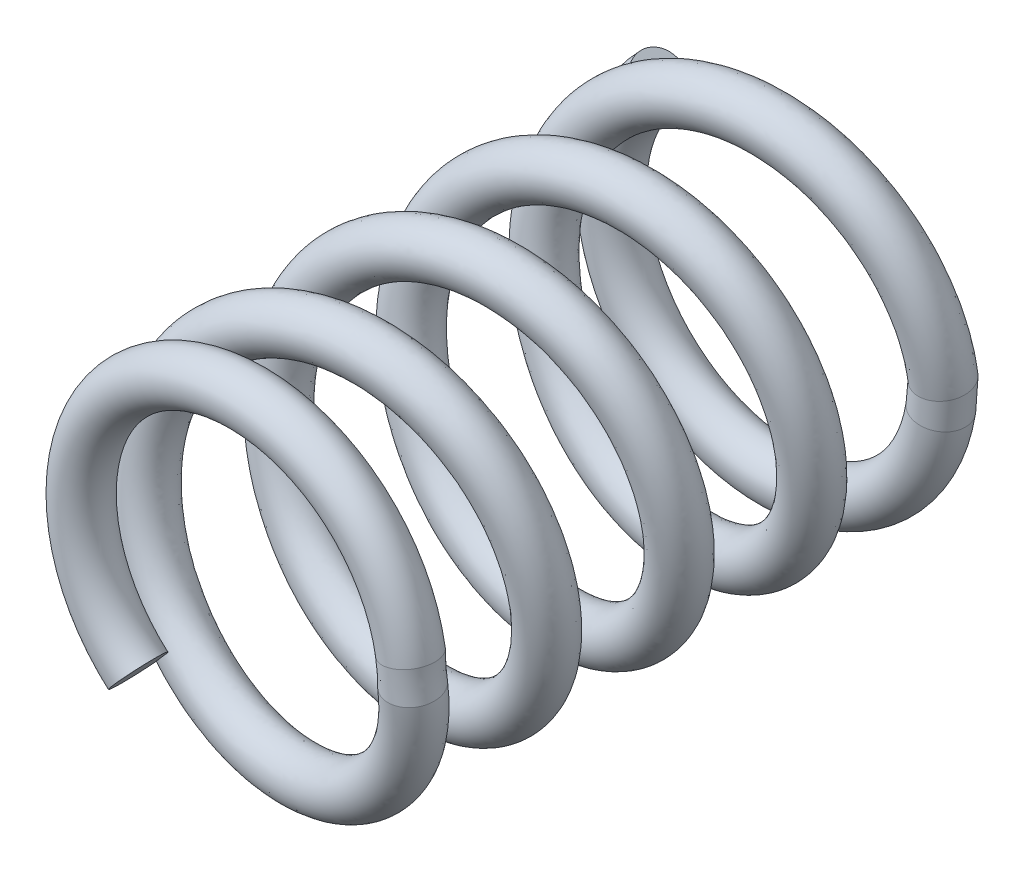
ISO-10303-21;
HEADER;
FILE_DESCRIPTION(('STEP AP214'),'2;1');
FILE_NAME('part.step','',(''),(''),'','','');
FILE_SCHEMA(('AUTOMOTIVE_DESIGN { 1 0 10303 214 1 1 1 1 }'));
ENDSEC;
DATA;
#1=APPLICATION_CONTEXT('core data for automotive mechanical design processes');
#2=APPLICATION_PROTOCOL_DEFINITION('international standard','automotive_design',2000,#1);
#3=PRODUCT_CONTEXT('',#1,'mechanical');
#4=PRODUCT('Part','Part','',(#3));
#5=PRODUCT_RELATED_PRODUCT_CATEGORY('part','',(#4));
#6=PRODUCT_DEFINITION_FORMATION('','',#4);
#7=PRODUCT_DEFINITION_CONTEXT('part definition',#1,'design');
#8=PRODUCT_DEFINITION('design','',#6,#7);
#9=PRODUCT_DEFINITION_SHAPE('','',#8);
#10=(LENGTH_UNIT() NAMED_UNIT(*) SI_UNIT(.MILLI.,.METRE.));
#11=(NAMED_UNIT(*) PLANE_ANGLE_UNIT() SI_UNIT($,.RADIAN.));
#12=(NAMED_UNIT(*) SI_UNIT($,.STERADIAN.) SOLID_ANGLE_UNIT());
#13=UNCERTAINTY_MEASURE_WITH_UNIT(LENGTH_MEASURE(1.E-05),#10,'distance_accuracy_value','');
#14=(GEOMETRIC_REPRESENTATION_CONTEXT(3) GLOBAL_UNCERTAINTY_ASSIGNED_CONTEXT((#13)) GLOBAL_UNIT_ASSIGNED_CONTEXT((#10,
#11,#12)) REPRESENTATION_CONTEXT('',''));
#15=CARTESIAN_POINT('',(0.,0.,0.));
#16=DIRECTION('',(0.,0.,1.));
#17=DIRECTION('',(1.,0.,0.));
#18=AXIS2_PLACEMENT_3D('',#15,#16,#17);
#19=CARTESIAN_POINT('',(0.,0.,0.));
#20=DIRECTION('',(0.,0.,-1.));
#21=DIRECTION('',(-1.,0.,0.));
#22=AXIS2_PLACEMENT_3D('',#19,#20,#21);
#23=TOROIDAL_SURFACE('',#22,5.,0.75);
#24=CARTESIAN_POINT('',(4.93351183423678,-0.812687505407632,0.));
#25=DIRECTION('',(-0.162537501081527,-0.986702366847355,0.));
#26=DIRECTION('',(0.986702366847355,-0.162537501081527,0.));
#27=AXIS2_PLACEMENT_3D('',#24,#25,#26);
#28=CIRCLE('',#27,0.75);
#29=CARTESIAN_POINT('',(5.67353860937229,-0.934590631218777,0.));
#30=VERTEX_POINT('',#29);
#31=EDGE_CURVE('E53',#30,#30,#28,.T.);
#32=CARTESIAN_POINT('',(-3.57071421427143,3.5,0.));
#33=DIRECTION('',(0.7,0.714142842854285,0.));
#34=DIRECTION('',(-0.714142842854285,0.7,0.));
#35=AXIS2_PLACEMENT_3D('',#32,#33,#34);
#36=CIRCLE('',#35,0.75);
#37=CARTESIAN_POINT('',(-4.10632134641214,4.025,0.));
#38=VERTEX_POINT('',#37);
#39=EDGE_CURVE('E60',#38,#38,#36,.T.);
#40=CARTESIAN_POINT('',(0.,0.,0.));
#41=DIRECTION('',(0.,0.,-1.));
#42=DIRECTION('',(-1.,0.,0.));
#43=AXIS2_PLACEMENT_3D('',#40,#41,#42);
#44=CIRCLE('',#43,5.75);
#45=EDGE_CURVE('',#30,#38,#44,.T.);
#46=ORIENTED_EDGE('',*,*,#31,.T.);
#47=ORIENTED_EDGE('',*,*,#39,.F.);
#48=ORIENTED_EDGE('',*,*,#45,.T.);
#49=ORIENTED_EDGE('',*,*,#45,.F.);
#50=EDGE_LOOP('',(#46,#48,#47,#49));
#51=FACE_BOUND('',#50,.T.);
#52=ADVANCED_FACE('F28',(#51),#23,.T.);
#53=CARTESIAN_POINT('',(-3.57071421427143,3.5,0.));
#54=DIRECTION('',(0.7,0.714142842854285,0.));
#55=DIRECTION('',(-0.714142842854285,0.7,0.));
#56=AXIS2_PLACEMENT_3D('',#53,#54,#55);
#57=PLANE('',#56);
#58=ORIENTED_EDGE('',*,*,#39,.T.);
#59=EDGE_LOOP('',(#58));
#60=FACE_BOUND('',#59,.T.);
#61=ADVANCED_FACE('F102',(#60),#57,.T.);
#62=CARTESIAN_POINT('',(5.47034736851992,0.0737733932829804,-0.579414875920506));
#63=CARTESIAN_POINT('',(5.39713317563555,-0.889058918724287,-0.58457049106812));
#64=CARTESIAN_POINT('',(6.63853247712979,-0.0450697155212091,0.353976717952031));
#65=CARTESIAN_POINT('',(6.55072734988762,-1.07908817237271,0.355168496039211));
#66=CARTESIAN_POINT('',(5.69760551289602,-0.19261650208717,1.51280646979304));
#67=CARTESIAN_POINT('',(5.62348466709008,-0.926345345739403,1.52430947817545));
#68=CARTESIAN_POINT('',(4.52942040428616,-0.0737733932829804,0.579414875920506));
#69=CARTESIAN_POINT('',(4.46989049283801,-0.736316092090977,0.584570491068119));
#70=CARTESIAN_POINT('',(3.3612352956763,0.0450697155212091,-0.353976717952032));
#71=CARTESIAN_POINT('',(3.31629631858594,-0.546286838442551,-0.355168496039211));
#72=CARTESIAN_POINT('',(4.30216225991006,0.19261650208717,-1.51280646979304));
#73=CARTESIAN_POINT('',(4.24353900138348,-0.699029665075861,-1.52430947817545));
#74=CARTESIAN_POINT('',(5.47034736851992,0.0737733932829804,-0.579414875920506));
#75=CARTESIAN_POINT('',(5.39713317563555,-0.889058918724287,-0.58457049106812));
#76=(BOUNDED_SURFACE() B_SPLINE_SURFACE(3,1,((#62,#63),(#64,#65),(#66,#67),(#68,#69),(#70,#71),
(#72,#73),(#74,#75)),.UNSPECIFIED.,.T.,.F.,.F.) B_SPLINE_SURFACE_WITH_KNOTS((4,3,4),(2,2),(0.,
0.5,1.),(0.,1.),.UNSPECIFIED.) GEOMETRIC_REPRESENTATION_ITEM() RATIONAL_B_SPLINE_SURFACE(((1.,
1.),(0.333333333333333,0.333333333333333),(0.333333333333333,0.333333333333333),(1.,1.),
(0.333333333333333,0.333333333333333),(0.333333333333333,0.333333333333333),(1.,1.))) REPRESENTATION_ITEM('') SURFACE());
#77=CARTESIAN_POINT('',(4.99988388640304,0.,0.));
#78=DIRECTION('',(0.,0.991991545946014,0.126304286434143));
#79=DIRECTION('',(0.,-0.126304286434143,0.991991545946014));
#80=AXIS2_PLACEMENT_3D('',#77,#78,#79);
#81=CIRCLE('',#80,0.75);
#82=CARTESIAN_POINT('',(4.99988388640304,-0.0947282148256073,0.743993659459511));
#83=VERTEX_POINT('',#82);
#84=EDGE_CURVE('E56',#83,#83,#81,.T.);
#85=ORIENTED_EDGE('',*,*,#84,.F.);
#86=EDGE_LOOP('',(#85));
#87=FACE_BOUND('',#86,.T.);
#88=ORIENTED_EDGE('',*,*,#31,.F.);
#89=EDGE_LOOP('',(#88));
#90=FACE_BOUND('',#89,.T.);
#91=ADVANCED_FACE('F99',(#87,#90),#76,.T.);
#92=CARTESIAN_POINT('',(4.99988388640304,-0.0947282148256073,0.743993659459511));
#93=CARTESIAN_POINT('',(5.025266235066,1.24498663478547,0.910660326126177));
#94=CARTESIAN_POINT('',(4.37739056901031,2.41790490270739,1.07732699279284));
#95=CARTESIAN_POINT('',(3.72951490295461,3.59082317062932,1.24399365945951));
#96=CARTESIAN_POINT('',(2.58197898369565,4.2826623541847,1.41066032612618));
#97=CARTESIAN_POINT('',(1.43444306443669,4.97450153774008,1.57732699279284));
#98=CARTESIAN_POINT('',(0.0947282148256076,4.99988388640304,1.74399365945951));
#99=CARTESIAN_POINT('',(-1.24498663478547,5.025266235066,1.91066032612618));
#100=CARTESIAN_POINT('',(-2.41790490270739,4.37739056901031,2.07732699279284));
#101=CARTESIAN_POINT('',(-3.59082317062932,3.72951490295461,2.24399365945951));
#102=CARTESIAN_POINT('',(-4.2826623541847,2.58197898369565,2.41066032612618));
#103=CARTESIAN_POINT('',(-4.97450153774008,1.43444306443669,2.57732699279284));
#104=CARTESIAN_POINT('',(-4.99988388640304,0.0947282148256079,2.74399365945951));
#105=CARTESIAN_POINT('',(-5.025266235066,-1.24498663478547,2.91066032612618));
#106=CARTESIAN_POINT('',(-4.37739056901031,-2.41790490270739,3.07732699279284));
#107=CARTESIAN_POINT('',(-3.72951490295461,-3.59082317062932,3.24399365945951));
#108=CARTESIAN_POINT('',(-2.58197898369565,-4.2826623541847,3.41066032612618));
#109=CARTESIAN_POINT('',(-1.43444306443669,-4.97450153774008,3.57732699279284));
#110=CARTESIAN_POINT('',(-0.0947282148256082,-4.99988388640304,3.74399365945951));
#111=CARTESIAN_POINT('',(1.24498663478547,-5.025266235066,3.91066032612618));
#112=CARTESIAN_POINT('',(2.41790490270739,-4.37739056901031,4.07732699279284));
#113=CARTESIAN_POINT('',(3.59082317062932,-3.72951490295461,4.24399365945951));
#114=CARTESIAN_POINT('',(4.2826623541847,-2.58197898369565,4.41066032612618));
#115=CARTESIAN_POINT('',(4.97450153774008,-1.43444306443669,4.57732699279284));
#116=CARTESIAN_POINT('',(4.99988388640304,-0.0947282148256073,4.74399365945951));
#117=CARTESIAN_POINT('',(5.025266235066,1.24498663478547,4.91066032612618));
#118=CARTESIAN_POINT('',(4.37739056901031,2.41790490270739,5.07732699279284));
#119=CARTESIAN_POINT('',(3.72951490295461,3.59082317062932,5.24399365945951));
#120=CARTESIAN_POINT('',(2.58197898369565,4.2826623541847,5.41066032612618));
#121=CARTESIAN_POINT('',(1.43444306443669,4.97450153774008,5.57732699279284));
#122=CARTESIAN_POINT('',(0.0947282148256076,4.99988388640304,5.74399365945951));
#123=CARTESIAN_POINT('',(-1.24498663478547,5.025266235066,5.91066032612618));
#124=CARTESIAN_POINT('',(-2.41790490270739,4.37739056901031,6.07732699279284));
#125=CARTESIAN_POINT('',(-3.59082317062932,3.72951490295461,6.24399365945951));
#126=CARTESIAN_POINT('',(-4.2826623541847,2.58197898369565,6.41066032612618));
#127=CARTESIAN_POINT('',(-4.97450153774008,1.43444306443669,6.57732699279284));
#128=CARTESIAN_POINT('',(-4.99988388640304,0.0947282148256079,6.74399365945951));
#129=CARTESIAN_POINT('',(-5.025266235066,-1.24498663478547,6.91066032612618));
#130=CARTESIAN_POINT('',(-4.37739056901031,-2.41790490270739,7.07732699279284));
#131=CARTESIAN_POINT('',(-3.72951490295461,-3.59082317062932,7.24399365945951));
#132=CARTESIAN_POINT('',(-2.58197898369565,-4.2826623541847,7.41066032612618));
#133=CARTESIAN_POINT('',(-1.43444306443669,-4.97450153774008,7.57732699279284));
#134=CARTESIAN_POINT('',(-0.0947282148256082,-4.99988388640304,7.74399365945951));
#135=CARTESIAN_POINT('',(1.24498663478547,-5.025266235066,7.91066032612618));
#136=CARTESIAN_POINT('',(2.41790490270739,-4.37739056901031,8.07732699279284));
#137=CARTESIAN_POINT('',(3.59082317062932,-3.72951490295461,8.24399365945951));
#138=CARTESIAN_POINT('',(4.2826623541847,-2.58197898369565,8.41066032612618));
#139=CARTESIAN_POINT('',(4.97450153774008,-1.43444306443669,8.57732699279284));
#140=CARTESIAN_POINT('',(4.99988388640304,-0.0947282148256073,8.74399365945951));
#141=CARTESIAN_POINT('',(5.025266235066,1.24498663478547,8.91066032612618));
#142=CARTESIAN_POINT('',(4.37739056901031,2.41790490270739,9.07732699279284));
#143=CARTESIAN_POINT('',(3.72951490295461,3.59082317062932,9.24399365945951));
#144=CARTESIAN_POINT('',(2.58197898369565,4.2826623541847,9.41066032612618));
#145=CARTESIAN_POINT('',(1.43444306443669,4.97450153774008,9.57732699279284));
#146=CARTESIAN_POINT('',(0.0947282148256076,4.99988388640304,9.74399365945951));
#147=CARTESIAN_POINT('',(-1.24498663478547,5.025266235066,9.91066032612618));
#148=CARTESIAN_POINT('',(-2.41790490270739,4.37739056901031,10.0773269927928));
#149=CARTESIAN_POINT('',(-3.59082317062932,3.72951490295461,10.2439936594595));
#150=CARTESIAN_POINT('',(-4.2826623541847,2.58197898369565,10.4106603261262));
#151=CARTESIAN_POINT('',(-4.97450153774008,1.43444306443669,10.5773269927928));
#152=CARTESIAN_POINT('',(-4.99988388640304,0.0947282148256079,10.7439936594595));
#153=CARTESIAN_POINT('',(-5.025266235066,-1.24498663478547,10.9106603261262));
#154=CARTESIAN_POINT('',(-4.37739056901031,-2.41790490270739,11.0773269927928));
#155=CARTESIAN_POINT('',(-3.72951490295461,-3.59082317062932,11.2439936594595));
#156=CARTESIAN_POINT('',(-2.58197898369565,-4.2826623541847,11.4106603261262));
#157=CARTESIAN_POINT('',(-1.43444306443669,-4.97450153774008,11.5773269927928));
#158=CARTESIAN_POINT('',(-0.0947282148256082,-4.99988388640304,11.7439936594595));
#159=CARTESIAN_POINT('',(1.24498663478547,-5.025266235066,11.9106603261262));
#160=CARTESIAN_POINT('',(2.41790490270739,-4.37739056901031,12.0773269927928));
#161=CARTESIAN_POINT('',(3.59082317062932,-3.72951490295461,12.2439936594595));
#162=CARTESIAN_POINT('',(4.2826623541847,-2.58197898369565,12.4106603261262));
#163=CARTESIAN_POINT('',(4.97450153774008,-1.43444306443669,12.5773269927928));
#164=CARTESIAN_POINT('',(4.99988388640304,-0.0947282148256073,12.7439936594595));
#165=CARTESIAN_POINT('',(5.025266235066,1.24498663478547,12.9106603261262));
#166=CARTESIAN_POINT('',(4.37739056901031,2.41790490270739,13.0773269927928));
#167=CARTESIAN_POINT('',(3.72951490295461,3.59082317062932,13.2439936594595));
#168=CARTESIAN_POINT('',(2.58197898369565,4.2826623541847,13.4106603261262));
#169=CARTESIAN_POINT('',(1.43444306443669,4.97450153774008,13.5773269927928));
#170=CARTESIAN_POINT('',(0.0947282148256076,4.99988388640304,13.7439936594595));
#171=CARTESIAN_POINT('',(-1.24498663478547,5.025266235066,13.9106603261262));
#172=CARTESIAN_POINT('',(-2.41790490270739,4.37739056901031,14.0773269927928));
#173=CARTESIAN_POINT('',(-3.59082317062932,3.72951490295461,14.2439936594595));
#174=CARTESIAN_POINT('',(-4.2826623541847,2.58197898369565,14.4106603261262));
#175=CARTESIAN_POINT('',(-4.97450153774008,1.43444306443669,14.5773269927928));
#176=CARTESIAN_POINT('',(-4.99988388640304,0.0947282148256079,14.7439936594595));
#177=CARTESIAN_POINT('',(-5.025266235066,-1.24498663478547,14.9106603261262));
#178=CARTESIAN_POINT('',(-4.37739056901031,-2.41790490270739,15.0773269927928));
#179=CARTESIAN_POINT('',(-3.72951490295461,-3.59082317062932,15.2439936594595));
#180=CARTESIAN_POINT('',(-2.58197898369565,-4.2826623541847,15.4106603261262));
#181=CARTESIAN_POINT('',(-1.43444306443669,-4.97450153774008,15.5773269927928));
#182=CARTESIAN_POINT('',(-0.0947282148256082,-4.99988388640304,15.7439936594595));
#183=CARTESIAN_POINT('',(1.24498663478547,-5.025266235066,15.9106603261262));
#184=CARTESIAN_POINT('',(2.41790490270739,-4.37739056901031,16.0773269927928));
#185=CARTESIAN_POINT('',(3.59082317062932,-3.72951490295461,16.2439936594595));
#186=CARTESIAN_POINT('',(4.2826623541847,-2.58197898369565,16.4106603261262));
#187=CARTESIAN_POINT('',(4.97450153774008,-1.43444306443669,16.5773269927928));
#188=CARTESIAN_POINT('',(4.99988388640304,-0.0947282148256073,16.7439936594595));
#189=CARTESIAN_POINT('',(5.19607127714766,-0.0947282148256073,0.743993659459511));
#190=CARTESIAN_POINT('',(5.22145362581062,1.29755488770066,0.910660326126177));
#191=CARTESIAN_POINT('',(4.54729383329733,2.5159985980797,1.07732699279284));
#192=CARTESIAN_POINT('',(3.87313404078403,3.73444230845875,1.24399365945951));
#193=CARTESIAN_POINT('',(2.68007267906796,4.45256561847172,1.41066032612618));
#194=CARTESIAN_POINT('',(1.48701131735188,5.17068892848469,1.57732699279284));
#195=CARTESIAN_POINT('',(0.0947282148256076,5.19607127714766,1.74399365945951));
#196=CARTESIAN_POINT('',(-1.29755488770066,5.22145362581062,1.91066032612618));
#197=CARTESIAN_POINT('',(-2.5159985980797,4.54729383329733,2.07732699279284));
#198=CARTESIAN_POINT('',(-3.73444230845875,3.87313404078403,2.24399365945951));
#199=CARTESIAN_POINT('',(-4.45256561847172,2.68007267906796,2.41066032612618));
#200=CARTESIAN_POINT('',(-5.17068892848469,1.48701131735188,2.57732699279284));
#201=CARTESIAN_POINT('',(-5.19607127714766,0.0947282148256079,2.74399365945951));
#202=CARTESIAN_POINT('',(-5.22145362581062,-1.29755488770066,2.91066032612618));
#203=CARTESIAN_POINT('',(-4.54729383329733,-2.5159985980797,3.07732699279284));
#204=CARTESIAN_POINT('',(-3.87313404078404,-3.73444230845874,3.24399365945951));
#205=CARTESIAN_POINT('',(-2.68007267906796,-4.45256561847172,3.41066032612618));
#206=CARTESIAN_POINT('',(-1.48701131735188,-5.17068892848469,3.57732699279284));
#207=CARTESIAN_POINT('',(-0.0947282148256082,-5.19607127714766,3.74399365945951));
#208=CARTESIAN_POINT('',(1.29755488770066,-5.22145362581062,3.91066032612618));
#209=CARTESIAN_POINT('',(2.5159985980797,-4.54729383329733,4.07732699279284));
#210=CARTESIAN_POINT('',(3.73444230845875,-3.87313404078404,4.24399365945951));
#211=CARTESIAN_POINT('',(4.45256561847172,-2.68007267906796,4.41066032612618));
#212=CARTESIAN_POINT('',(5.17068892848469,-1.48701131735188,4.57732699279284));
#213=CARTESIAN_POINT('',(5.19607127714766,-0.0947282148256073,4.74399365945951));
#214=CARTESIAN_POINT('',(5.22145362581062,1.29755488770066,4.91066032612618));
#215=CARTESIAN_POINT('',(4.54729383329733,2.5159985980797,5.07732699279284));
#216=CARTESIAN_POINT('',(3.87313404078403,3.73444230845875,5.24399365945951));
#217=CARTESIAN_POINT('',(2.68007267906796,4.45256561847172,5.41066032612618));
#218=CARTESIAN_POINT('',(1.48701131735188,5.17068892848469,5.57732699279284));
#219=CARTESIAN_POINT('',(0.0947282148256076,5.19607127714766,5.74399365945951));
#220=CARTESIAN_POINT('',(-1.29755488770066,5.22145362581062,5.91066032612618));
#221=CARTESIAN_POINT('',(-2.5159985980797,4.54729383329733,6.07732699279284));
#222=CARTESIAN_POINT('',(-3.73444230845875,3.87313404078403,6.24399365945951));
#223=CARTESIAN_POINT('',(-4.45256561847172,2.68007267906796,6.41066032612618));
#224=CARTESIAN_POINT('',(-5.17068892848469,1.48701131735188,6.57732699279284));
#225=CARTESIAN_POINT('',(-5.19607127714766,0.0947282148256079,6.74399365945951));
#226=CARTESIAN_POINT('',(-5.22145362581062,-1.29755488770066,6.91066032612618));
#227=CARTESIAN_POINT('',(-4.54729383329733,-2.5159985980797,7.07732699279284));
#228=CARTESIAN_POINT('',(-3.87313404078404,-3.73444230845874,7.24399365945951));
#229=CARTESIAN_POINT('',(-2.68007267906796,-4.45256561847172,7.41066032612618));
#230=CARTESIAN_POINT('',(-1.48701131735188,-5.17068892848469,7.57732699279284));
#231=CARTESIAN_POINT('',(-0.0947282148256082,-5.19607127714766,7.74399365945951));
#232=CARTESIAN_POINT('',(1.29755488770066,-5.22145362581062,7.91066032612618));
#233=CARTESIAN_POINT('',(2.5159985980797,-4.54729383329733,8.07732699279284));
#234=CARTESIAN_POINT('',(3.73444230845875,-3.87313404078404,8.24399365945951));
#235=CARTESIAN_POINT('',(4.45256561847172,-2.68007267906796,8.41066032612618));
#236=CARTESIAN_POINT('',(5.17068892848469,-1.48701131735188,8.57732699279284));
#237=CARTESIAN_POINT('',(5.19607127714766,-0.0947282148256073,8.74399365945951));
#238=CARTESIAN_POINT('',(5.22145362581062,1.29755488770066,8.91066032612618));
#239=CARTESIAN_POINT('',(4.54729383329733,2.5159985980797,9.07732699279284));
#240=CARTESIAN_POINT('',(3.87313404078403,3.73444230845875,9.24399365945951));
#241=CARTESIAN_POINT('',(2.68007267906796,4.45256561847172,9.41066032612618));
#242=CARTESIAN_POINT('',(1.48701131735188,5.17068892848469,9.57732699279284));
#243=CARTESIAN_POINT('',(0.0947282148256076,5.19607127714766,9.74399365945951));
#244=CARTESIAN_POINT('',(-1.29755488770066,5.22145362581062,9.91066032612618));
#245=CARTESIAN_POINT('',(-2.5159985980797,4.54729383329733,10.0773269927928));
#246=CARTESIAN_POINT('',(-3.73444230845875,3.87313404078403,10.2439936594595));
#247=CARTESIAN_POINT('',(-4.45256561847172,2.68007267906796,10.4106603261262));
#248=CARTESIAN_POINT('',(-5.17068892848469,1.48701131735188,10.5773269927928));
#249=CARTESIAN_POINT('',(-5.19607127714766,0.0947282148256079,10.7439936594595));
#250=CARTESIAN_POINT('',(-5.22145362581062,-1.29755488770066,10.9106603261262));
#251=CARTESIAN_POINT('',(-4.54729383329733,-2.5159985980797,11.0773269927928));
#252=CARTESIAN_POINT('',(-3.87313404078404,-3.73444230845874,11.2439936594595));
#253=CARTESIAN_POINT('',(-2.68007267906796,-4.45256561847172,11.4106603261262));
#254=CARTESIAN_POINT('',(-1.48701131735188,-5.17068892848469,11.5773269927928));
#255=CARTESIAN_POINT('',(-0.0947282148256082,-5.19607127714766,11.7439936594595));
#256=CARTESIAN_POINT('',(1.29755488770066,-5.22145362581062,11.9106603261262));
#257=CARTESIAN_POINT('',(2.5159985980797,-4.54729383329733,12.0773269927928));
#258=CARTESIAN_POINT('',(3.73444230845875,-3.87313404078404,12.2439936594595));
#259=CARTESIAN_POINT('',(4.45256561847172,-2.68007267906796,12.4106603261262));
#260=CARTESIAN_POINT('',(5.17068892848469,-1.48701131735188,12.5773269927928));
#261=CARTESIAN_POINT('',(5.19607127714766,-0.0947282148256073,12.7439936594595));
#262=CARTESIAN_POINT('',(5.22145362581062,1.29755488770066,12.9106603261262));
#263=CARTESIAN_POINT('',(4.54729383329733,2.5159985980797,13.0773269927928));
#264=CARTESIAN_POINT('',(3.87313404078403,3.73444230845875,13.2439936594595));
#265=CARTESIAN_POINT('',(2.68007267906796,4.45256561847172,13.4106603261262));
#266=CARTESIAN_POINT('',(1.48701131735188,5.17068892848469,13.5773269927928));
#267=CARTESIAN_POINT('',(0.0947282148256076,5.19607127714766,13.7439936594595));
#268=CARTESIAN_POINT('',(-1.29755488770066,5.22145362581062,13.9106603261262));
#269=CARTESIAN_POINT('',(-2.5159985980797,4.54729383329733,14.0773269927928));
#270=CARTESIAN_POINT('',(-3.73444230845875,3.87313404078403,14.2439936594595));
#271=CARTESIAN_POINT('',(-4.45256561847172,2.68007267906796,14.4106603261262));
#272=CARTESIAN_POINT('',(-5.17068892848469,1.48701131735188,14.5773269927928));
#273=CARTESIAN_POINT('',(-5.19607127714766,0.0947282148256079,14.7439936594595));
#274=CARTESIAN_POINT('',(-5.22145362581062,-1.29755488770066,14.9106603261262));
#275=CARTESIAN_POINT('',(-4.54729383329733,-2.5159985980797,15.0773269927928));
#276=CARTESIAN_POINT('',(-3.87313404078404,-3.73444230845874,15.2439936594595));
#277=CARTESIAN_POINT('',(-2.68007267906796,-4.45256561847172,15.4106603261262));
#278=CARTESIAN_POINT('',(-1.48701131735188,-5.17068892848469,15.5773269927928));
#279=CARTESIAN_POINT('',(-0.0947282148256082,-5.19607127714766,15.7439936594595));
#280=CARTESIAN_POINT('',(1.29755488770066,-5.22145362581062,15.9106603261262));
#281=CARTESIAN_POINT('',(2.5159985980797,-4.54729383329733,16.0773269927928));
#282=CARTESIAN_POINT('',(3.73444230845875,-3.87313404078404,16.2439936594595));
#283=CARTESIAN_POINT('',(4.45256561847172,-2.68007267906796,16.4106603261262));
#284=CARTESIAN_POINT('',(5.17068892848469,-1.48701131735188,16.5773269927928));
#285=CARTESIAN_POINT('',(5.19607127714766,-0.0947282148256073,16.7439936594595));
#286=CARTESIAN_POINT('',(5.74988388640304,-0.0804742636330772,0.632043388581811));
#287=CARTESIAN_POINT('',(5.77144690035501,1.46020248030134,0.798710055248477));
#288=CARTESIAN_POINT('',(5.01978264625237,2.80524918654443,0.965376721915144));
#289=CARTESIAN_POINT('',(4.26811839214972,4.15029589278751,1.13204338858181));
#290=CARTESIAN_POINT('',(2.94463469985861,4.93930838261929,1.29871005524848));
#291=CARTESIAN_POINT('',(1.6211510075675,5.72832087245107,1.46537672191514));
#292=CARTESIAN_POINT('',(0.0804742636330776,5.74988388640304,1.63204338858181));
#293=CARTESIAN_POINT('',(-1.46020248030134,5.77144690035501,1.79871005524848));
#294=CARTESIAN_POINT('',(-2.80524918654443,5.01978264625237,1.96537672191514));
#295=CARTESIAN_POINT('',(-4.15029589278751,4.26811839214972,2.13204338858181));
#296=CARTESIAN_POINT('',(-4.93930838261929,2.94463469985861,2.29871005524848));
#297=CARTESIAN_POINT('',(-5.72832087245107,1.6211510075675,2.46537672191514));
#298=CARTESIAN_POINT('',(-5.74988388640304,0.0804742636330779,2.63204338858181));
#299=CARTESIAN_POINT('',(-5.77144690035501,-1.46020248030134,2.79871005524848));
#300=CARTESIAN_POINT('',(-5.01978264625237,-2.80524918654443,2.96537672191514));
#301=CARTESIAN_POINT('',(-4.26811839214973,-4.15029589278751,3.13204338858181));
#302=CARTESIAN_POINT('',(-2.94463469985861,-4.93930838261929,3.29871005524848));
#303=CARTESIAN_POINT('',(-1.6211510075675,-5.72832087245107,3.46537672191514));
#304=CARTESIAN_POINT('',(-0.0804742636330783,-5.74988388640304,3.63204338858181));
#305=CARTESIAN_POINT('',(1.46020248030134,-5.77144690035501,3.79871005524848));
#306=CARTESIAN_POINT('',(2.80524918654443,-5.01978264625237,3.96537672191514));
#307=CARTESIAN_POINT('',(4.15029589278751,-4.26811839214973,4.13204338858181));
#308=CARTESIAN_POINT('',(4.93930838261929,-2.94463469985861,4.29871005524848));
#309=CARTESIAN_POINT('',(5.72832087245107,-1.6211510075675,4.46537672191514));
#310=CARTESIAN_POINT('',(5.74988388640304,-0.0804742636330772,4.63204338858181));
#311=CARTESIAN_POINT('',(5.77144690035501,1.46020248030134,4.79871005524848));
#312=CARTESIAN_POINT('',(5.01978264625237,2.80524918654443,4.96537672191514));
#313=CARTESIAN_POINT('',(4.26811839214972,4.15029589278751,5.13204338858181));
#314=CARTESIAN_POINT('',(2.94463469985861,4.93930838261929,5.29871005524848));
#315=CARTESIAN_POINT('',(1.6211510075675,5.72832087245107,5.46537672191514));
#316=CARTESIAN_POINT('',(0.0804742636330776,5.74988388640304,5.63204338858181));
#317=CARTESIAN_POINT('',(-1.46020248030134,5.77144690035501,5.79871005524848));
#318=CARTESIAN_POINT('',(-2.80524918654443,5.01978264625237,5.96537672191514));
#319=CARTESIAN_POINT('',(-4.15029589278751,4.26811839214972,6.13204338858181));
#320=CARTESIAN_POINT('',(-4.93930838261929,2.94463469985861,6.29871005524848));
#321=CARTESIAN_POINT('',(-5.72832087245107,1.6211510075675,6.46537672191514));
#322=CARTESIAN_POINT('',(-5.74988388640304,0.0804742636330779,6.63204338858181));
#323=CARTESIAN_POINT('',(-5.77144690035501,-1.46020248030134,6.79871005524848));
#324=CARTESIAN_POINT('',(-5.01978264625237,-2.80524918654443,6.96537672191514));
#325=CARTESIAN_POINT('',(-4.26811839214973,-4.15029589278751,7.13204338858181));
#326=CARTESIAN_POINT('',(-2.94463469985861,-4.93930838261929,7.29871005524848));
#327=CARTESIAN_POINT('',(-1.6211510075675,-5.72832087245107,7.46537672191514));
#328=CARTESIAN_POINT('',(-0.0804742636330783,-5.74988388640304,7.63204338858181));
#329=CARTESIAN_POINT('',(1.46020248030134,-5.77144690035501,7.79871005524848));
#330=CARTESIAN_POINT('',(2.80524918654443,-5.01978264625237,7.96537672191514));
#331=CARTESIAN_POINT('',(4.15029589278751,-4.26811839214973,8.13204338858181));
#332=CARTESIAN_POINT('',(4.93930838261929,-2.94463469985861,8.29871005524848));
#333=CARTESIAN_POINT('',(5.72832087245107,-1.6211510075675,8.46537672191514));
#334=CARTESIAN_POINT('',(5.74988388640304,-0.0804742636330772,8.63204338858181));
#335=CARTESIAN_POINT('',(5.77144690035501,1.46020248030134,8.79871005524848));
#336=CARTESIAN_POINT('',(5.01978264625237,2.80524918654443,8.96537672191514));
#337=CARTESIAN_POINT('',(4.26811839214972,4.15029589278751,9.13204338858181));
#338=CARTESIAN_POINT('',(2.94463469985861,4.93930838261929,9.29871005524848));
#339=CARTESIAN_POINT('',(1.6211510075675,5.72832087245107,9.46537672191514));
#340=CARTESIAN_POINT('',(0.0804742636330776,5.74988388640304,9.63204338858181));
#341=CARTESIAN_POINT('',(-1.46020248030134,5.77144690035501,9.79871005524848));
#342=CARTESIAN_POINT('',(-2.80524918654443,5.01978264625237,9.96537672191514));
#343=CARTESIAN_POINT('',(-4.15029589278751,4.26811839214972,10.1320433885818));
#344=CARTESIAN_POINT('',(-4.93930838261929,2.94463469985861,10.2987100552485));
#345=CARTESIAN_POINT('',(-5.72832087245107,1.6211510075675,10.4653767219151));
#346=CARTESIAN_POINT('',(-5.74988388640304,0.0804742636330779,10.6320433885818));
#347=CARTESIAN_POINT('',(-5.77144690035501,-1.46020248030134,10.7987100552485));
#348=CARTESIAN_POINT('',(-5.01978264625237,-2.80524918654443,10.9653767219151));
#349=CARTESIAN_POINT('',(-4.26811839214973,-4.15029589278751,11.1320433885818));
#350=CARTESIAN_POINT('',(-2.94463469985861,-4.93930838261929,11.2987100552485));
#351=CARTESIAN_POINT('',(-1.6211510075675,-5.72832087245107,11.4653767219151));
#352=CARTESIAN_POINT('',(-0.0804742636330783,-5.74988388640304,11.6320433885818));
#353=CARTESIAN_POINT('',(1.46020248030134,-5.77144690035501,11.7987100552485));
#354=CARTESIAN_POINT('',(2.80524918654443,-5.01978264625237,11.9653767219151));
#355=CARTESIAN_POINT('',(4.15029589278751,-4.26811839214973,12.1320433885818));
#356=CARTESIAN_POINT('',(4.93930838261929,-2.94463469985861,12.2987100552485));
#357=CARTESIAN_POINT('',(5.72832087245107,-1.6211510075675,12.4653767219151));
#358=CARTESIAN_POINT('',(5.74988388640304,-0.0804742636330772,12.6320433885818));
#359=CARTESIAN_POINT('',(5.77144690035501,1.46020248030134,12.7987100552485));
#360=CARTESIAN_POINT('',(5.01978264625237,2.80524918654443,12.9653767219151));
#361=CARTESIAN_POINT('',(4.26811839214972,4.15029589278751,13.1320433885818));
#362=CARTESIAN_POINT('',(2.94463469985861,4.93930838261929,13.2987100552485));
#363=CARTESIAN_POINT('',(1.6211510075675,5.72832087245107,13.4653767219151));
#364=CARTESIAN_POINT('',(0.0804742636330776,5.74988388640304,13.6320433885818));
#365=CARTESIAN_POINT('',(-1.46020248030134,5.77144690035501,13.7987100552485));
#366=CARTESIAN_POINT('',(-2.80524918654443,5.01978264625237,13.9653767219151));
#367=CARTESIAN_POINT('',(-4.15029589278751,4.26811839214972,14.1320433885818));
#368=CARTESIAN_POINT('',(-4.93930838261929,2.94463469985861,14.2987100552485));
#369=CARTESIAN_POINT('',(-5.72832087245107,1.6211510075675,14.4653767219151));
#370=CARTESIAN_POINT('',(-5.74988388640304,0.0804742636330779,14.6320433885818));
#371=CARTESIAN_POINT('',(-5.77144690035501,-1.46020248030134,14.7987100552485));
#372=CARTESIAN_POINT('',(-5.01978264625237,-2.80524918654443,14.9653767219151));
#373=CARTESIAN_POINT('',(-4.26811839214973,-4.15029589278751,15.1320433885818));
#374=CARTESIAN_POINT('',(-2.94463469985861,-4.93930838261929,15.2987100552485));
#375=CARTESIAN_POINT('',(-1.6211510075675,-5.72832087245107,15.4653767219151));
#376=CARTESIAN_POINT('',(-0.0804742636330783,-5.74988388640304,15.6320433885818));
#377=CARTESIAN_POINT('',(1.46020248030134,-5.77144690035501,15.7987100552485));
#378=CARTESIAN_POINT('',(2.80524918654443,-5.01978264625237,15.9653767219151));
#379=CARTESIAN_POINT('',(4.15029589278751,-4.26811839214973,16.1320433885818));
#380=CARTESIAN_POINT('',(4.93930838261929,-2.94463469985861,16.2987100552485));
#381=CARTESIAN_POINT('',(5.72832087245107,-1.6211510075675,16.4653767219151));
#382=CARTESIAN_POINT('',(5.74988388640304,-0.0804742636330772,16.6320433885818));
#383=CARTESIAN_POINT('',(5.74988388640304,0.0804742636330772,-0.63204338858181));
#384=CARTESIAN_POINT('',(5.72832087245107,1.6211510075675,-0.465376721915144));
#385=CARTESIAN_POINT('',(4.93930838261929,2.94463469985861,-0.298710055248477));
#386=CARTESIAN_POINT('',(4.15029589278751,4.26811839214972,-0.13204338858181));
#387=CARTESIAN_POINT('',(2.80524918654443,5.01978264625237,0.0346232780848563));
#388=CARTESIAN_POINT('',(1.46020248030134,5.77144690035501,0.201289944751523));
#389=CARTESIAN_POINT('',(-0.0804742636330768,5.74988388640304,0.36795661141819));
#390=CARTESIAN_POINT('',(-1.6211510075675,5.72832087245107,0.534623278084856));
#391=CARTESIAN_POINT('',(-2.94463469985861,4.93930838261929,0.701289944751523));
#392=CARTESIAN_POINT('',(-4.26811839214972,4.15029589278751,0.86795661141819));
#393=CARTESIAN_POINT('',(-5.01978264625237,2.80524918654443,1.03462327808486));
#394=CARTESIAN_POINT('',(-5.77144690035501,1.46020248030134,1.20128994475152));
#395=CARTESIAN_POINT('',(-5.74988388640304,-0.0804742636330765,1.36795661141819));
#396=CARTESIAN_POINT('',(-5.72832087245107,-1.62115100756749,1.53462327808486));
#397=CARTESIAN_POINT('',(-4.93930838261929,-2.94463469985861,1.70128994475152));
#398=CARTESIAN_POINT('',(-4.15029589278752,-4.26811839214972,1.86795661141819));
#399=CARTESIAN_POINT('',(-2.80524918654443,-5.01978264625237,2.03462327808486));
#400=CARTESIAN_POINT('',(-1.46020248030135,-5.77144690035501,2.20128994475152));
#401=CARTESIAN_POINT('',(0.0804742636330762,-5.74988388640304,2.36795661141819));
#402=CARTESIAN_POINT('',(1.62115100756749,-5.72832087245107,2.53462327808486));
#403=CARTESIAN_POINT('',(2.94463469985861,-4.93930838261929,2.70128994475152));
#404=CARTESIAN_POINT('',(4.26811839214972,-4.15029589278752,2.86795661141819));
#405=CARTESIAN_POINT('',(5.01978264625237,-2.80524918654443,3.03462327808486));
#406=CARTESIAN_POINT('',(5.77144690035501,-1.46020248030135,3.20128994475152));
#407=CARTESIAN_POINT('',(5.74988388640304,0.0804742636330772,3.36795661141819));
#408=CARTESIAN_POINT('',(5.72832087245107,1.6211510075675,3.53462327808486));
#409=CARTESIAN_POINT('',(4.93930838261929,2.94463469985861,3.70128994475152));
#410=CARTESIAN_POINT('',(4.15029589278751,4.26811839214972,3.86795661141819));
#411=CARTESIAN_POINT('',(2.80524918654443,5.01978264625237,4.03462327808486));
#412=CARTESIAN_POINT('',(1.46020248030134,5.77144690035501,4.20128994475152));
#413=CARTESIAN_POINT('',(-0.0804742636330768,5.74988388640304,4.36795661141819));
#414=CARTESIAN_POINT('',(-1.6211510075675,5.72832087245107,4.53462327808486));
#415=CARTESIAN_POINT('',(-2.94463469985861,4.93930838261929,4.70128994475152));
#416=CARTESIAN_POINT('',(-4.26811839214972,4.15029589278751,4.86795661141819));
#417=CARTESIAN_POINT('',(-5.01978264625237,2.80524918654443,5.03462327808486));
#418=CARTESIAN_POINT('',(-5.77144690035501,1.46020248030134,5.20128994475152));
#419=CARTESIAN_POINT('',(-5.74988388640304,-0.0804742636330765,5.36795661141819));
#420=CARTESIAN_POINT('',(-5.72832087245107,-1.62115100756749,5.53462327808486));
#421=CARTESIAN_POINT('',(-4.93930838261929,-2.94463469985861,5.70128994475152));
#422=CARTESIAN_POINT('',(-4.15029589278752,-4.26811839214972,5.86795661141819));
#423=CARTESIAN_POINT('',(-2.80524918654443,-5.01978264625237,6.03462327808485));
#424=CARTESIAN_POINT('',(-1.46020248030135,-5.77144690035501,6.20128994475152));
#425=CARTESIAN_POINT('',(0.0804742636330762,-5.74988388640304,6.36795661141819));
#426=CARTESIAN_POINT('',(1.62115100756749,-5.72832087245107,6.53462327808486));
#427=CARTESIAN_POINT('',(2.94463469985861,-4.93930838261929,6.70128994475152));
#428=CARTESIAN_POINT('',(4.26811839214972,-4.15029589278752,6.86795661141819));
#429=CARTESIAN_POINT('',(5.01978264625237,-2.80524918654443,7.03462327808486));
#430=CARTESIAN_POINT('',(5.77144690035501,-1.46020248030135,7.20128994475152));
#431=CARTESIAN_POINT('',(5.74988388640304,0.0804742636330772,7.36795661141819));
#432=CARTESIAN_POINT('',(5.72832087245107,1.6211510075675,7.53462327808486));
#433=CARTESIAN_POINT('',(4.93930838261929,2.94463469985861,7.70128994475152));
#434=CARTESIAN_POINT('',(4.15029589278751,4.26811839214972,7.86795661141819));
#435=CARTESIAN_POINT('',(2.80524918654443,5.01978264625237,8.03462327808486));
#436=CARTESIAN_POINT('',(1.46020248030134,5.77144690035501,8.20128994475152));
#437=CARTESIAN_POINT('',(-0.0804742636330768,5.74988388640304,8.36795661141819));
#438=CARTESIAN_POINT('',(-1.6211510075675,5.72832087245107,8.53462327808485));
#439=CARTESIAN_POINT('',(-2.94463469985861,4.93930838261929,8.70128994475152));
#440=CARTESIAN_POINT('',(-4.26811839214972,4.15029589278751,8.86795661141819));
#441=CARTESIAN_POINT('',(-5.01978264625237,2.80524918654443,9.03462327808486));
#442=CARTESIAN_POINT('',(-5.77144690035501,1.46020248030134,9.20128994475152));
#443=CARTESIAN_POINT('',(-5.74988388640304,-0.0804742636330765,9.36795661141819));
#444=CARTESIAN_POINT('',(-5.72832087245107,-1.62115100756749,9.53462327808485));
#445=CARTESIAN_POINT('',(-4.93930838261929,-2.94463469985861,9.70128994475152));
#446=CARTESIAN_POINT('',(-4.15029589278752,-4.26811839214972,9.86795661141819));
#447=CARTESIAN_POINT('',(-2.80524918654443,-5.01978264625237,10.0346232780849));
#448=CARTESIAN_POINT('',(-1.46020248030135,-5.77144690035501,10.2012899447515));
#449=CARTESIAN_POINT('',(0.0804742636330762,-5.74988388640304,10.3679566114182));
#450=CARTESIAN_POINT('',(1.62115100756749,-5.72832087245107,10.5346232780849));
#451=CARTESIAN_POINT('',(2.94463469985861,-4.93930838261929,10.7012899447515));
#452=CARTESIAN_POINT('',(4.26811839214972,-4.15029589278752,10.8679566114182));
#453=CARTESIAN_POINT('',(5.01978264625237,-2.80524918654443,11.0346232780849));
#454=CARTESIAN_POINT('',(5.77144690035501,-1.46020248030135,11.2012899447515));
#455=CARTESIAN_POINT('',(5.74988388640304,0.0804742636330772,11.3679566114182));
#456=CARTESIAN_POINT('',(5.72832087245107,1.6211510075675,11.5346232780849));
#457=CARTESIAN_POINT('',(4.93930838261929,2.94463469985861,11.7012899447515));
#458=CARTESIAN_POINT('',(4.15029589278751,4.26811839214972,11.8679566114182));
#459=CARTESIAN_POINT('',(2.80524918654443,5.01978264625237,12.0346232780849));
#460=CARTESIAN_POINT('',(1.46020248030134,5.77144690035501,12.2012899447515));
#461=CARTESIAN_POINT('',(-0.0804742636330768,5.74988388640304,12.3679566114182));
#462=CARTESIAN_POINT('',(-1.6211510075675,5.72832087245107,12.5346232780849));
#463=CARTESIAN_POINT('',(-2.94463469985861,4.93930838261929,12.7012899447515));
#464=CARTESIAN_POINT('',(-4.26811839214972,4.15029589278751,12.8679566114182));
#465=CARTESIAN_POINT('',(-5.01978264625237,2.80524918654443,13.0346232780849));
#466=CARTESIAN_POINT('',(-5.77144690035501,1.46020248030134,13.2012899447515));
#467=CARTESIAN_POINT('',(-5.74988388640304,-0.0804742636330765,13.3679566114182));
#468=CARTESIAN_POINT('',(-5.72832087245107,-1.62115100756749,13.5346232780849));
#469=CARTESIAN_POINT('',(-4.93930838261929,-2.94463469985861,13.7012899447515));
#470=CARTESIAN_POINT('',(-4.15029589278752,-4.26811839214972,13.8679566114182));
#471=CARTESIAN_POINT('',(-2.80524918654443,-5.01978264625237,14.0346232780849));
#472=CARTESIAN_POINT('',(-1.46020248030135,-5.77144690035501,14.2012899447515));
#473=CARTESIAN_POINT('',(0.0804742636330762,-5.74988388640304,14.3679566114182));
#474=CARTESIAN_POINT('',(1.62115100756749,-5.72832087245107,14.5346232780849));
#475=CARTESIAN_POINT('',(2.94463469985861,-4.93930838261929,14.7012899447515));
#476=CARTESIAN_POINT('',(4.26811839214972,-4.15029589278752,14.8679566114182));
#477=CARTESIAN_POINT('',(5.01978264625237,-2.80524918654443,15.0346232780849));
#478=CARTESIAN_POINT('',(5.77144690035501,-1.46020248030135,15.2012899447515));
#479=CARTESIAN_POINT('',(5.74988388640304,0.0804742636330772,15.3679566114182));
#480=CARTESIAN_POINT('',(5.19607127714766,0.0947282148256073,-0.743993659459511));
#481=CARTESIAN_POINT('',(5.17068892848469,1.48701131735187,-0.577326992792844));
#482=CARTESIAN_POINT('',(4.45256561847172,2.68007267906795,-0.410660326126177));
#483=CARTESIAN_POINT('',(3.73444230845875,3.87313404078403,-0.243993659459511));
#484=CARTESIAN_POINT('',(2.5159985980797,4.54729383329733,-0.0773269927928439));
#485=CARTESIAN_POINT('',(1.29755488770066,5.22145362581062,0.0893396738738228));
#486=CARTESIAN_POINT('',(-0.094728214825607,5.19607127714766,0.256006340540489));
#487=CARTESIAN_POINT('',(-1.48701131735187,5.17068892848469,0.422673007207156));
#488=CARTESIAN_POINT('',(-2.68007267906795,4.45256561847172,0.589339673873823));
#489=CARTESIAN_POINT('',(-3.87313404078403,3.73444230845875,0.75600634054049));
#490=CARTESIAN_POINT('',(-4.54729383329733,2.51599859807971,0.922673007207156));
#491=CARTESIAN_POINT('',(-5.22145362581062,1.29755488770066,1.08933967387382));
#492=CARTESIAN_POINT('',(-5.19607127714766,-0.0947282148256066,1.25600634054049));
#493=CARTESIAN_POINT('',(-5.17068892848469,-1.48701131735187,1.42267300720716));
#494=CARTESIAN_POINT('',(-4.45256561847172,-2.68007267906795,1.58933967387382));
#495=CARTESIAN_POINT('',(-3.73444230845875,-3.87313404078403,1.75600634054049));
#496=CARTESIAN_POINT('',(-2.51599859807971,-4.54729383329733,1.92267300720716));
#497=CARTESIAN_POINT('',(-1.29755488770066,-5.22145362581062,2.08933967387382));
#498=CARTESIAN_POINT('',(0.0947282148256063,-5.19607127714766,2.25600634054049));
#499=CARTESIAN_POINT('',(1.48701131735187,-5.17068892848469,2.42267300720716));
#500=CARTESIAN_POINT('',(2.68007267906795,-4.45256561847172,2.58933967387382));
#501=CARTESIAN_POINT('',(3.87313404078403,-3.73444230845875,2.75600634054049));
#502=CARTESIAN_POINT('',(4.54729383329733,-2.51599859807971,2.92267300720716));
#503=CARTESIAN_POINT('',(5.22145362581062,-1.29755488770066,3.08933967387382));
#504=CARTESIAN_POINT('',(5.19607127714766,0.0947282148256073,3.25600634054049));
#505=CARTESIAN_POINT('',(5.17068892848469,1.48701131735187,3.42267300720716));
#506=CARTESIAN_POINT('',(4.45256561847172,2.68007267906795,3.58933967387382));
#507=CARTESIAN_POINT('',(3.73444230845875,3.87313404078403,3.75600634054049));
#508=CARTESIAN_POINT('',(2.5159985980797,4.54729383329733,3.92267300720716));
#509=CARTESIAN_POINT('',(1.29755488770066,5.22145362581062,4.08933967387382));
#510=CARTESIAN_POINT('',(-0.094728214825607,5.19607127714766,4.25600634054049));
#511=CARTESIAN_POINT('',(-1.48701131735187,5.17068892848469,4.42267300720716));
#512=CARTESIAN_POINT('',(-2.68007267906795,4.45256561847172,4.58933967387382));
#513=CARTESIAN_POINT('',(-3.87313404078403,3.73444230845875,4.75600634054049));
#514=CARTESIAN_POINT('',(-4.54729383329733,2.51599859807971,4.92267300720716));
#515=CARTESIAN_POINT('',(-5.22145362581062,1.29755488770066,5.08933967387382));
#516=CARTESIAN_POINT('',(-5.19607127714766,-0.0947282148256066,5.25600634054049));
#517=CARTESIAN_POINT('',(-5.17068892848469,-1.48701131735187,5.42267300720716));
#518=CARTESIAN_POINT('',(-4.45256561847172,-2.68007267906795,5.58933967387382));
#519=CARTESIAN_POINT('',(-3.73444230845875,-3.87313404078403,5.75600634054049));
#520=CARTESIAN_POINT('',(-2.51599859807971,-4.54729383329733,5.92267300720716));
#521=CARTESIAN_POINT('',(-1.29755488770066,-5.22145362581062,6.08933967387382));
#522=CARTESIAN_POINT('',(0.0947282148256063,-5.19607127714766,6.25600634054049));
#523=CARTESIAN_POINT('',(1.48701131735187,-5.17068892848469,6.42267300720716));
#524=CARTESIAN_POINT('',(2.68007267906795,-4.45256561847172,6.58933967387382));
#525=CARTESIAN_POINT('',(3.87313404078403,-3.73444230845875,6.75600634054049));
#526=CARTESIAN_POINT('',(4.54729383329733,-2.51599859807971,6.92267300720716));
#527=CARTESIAN_POINT('',(5.22145362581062,-1.29755488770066,7.08933967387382));
#528=CARTESIAN_POINT('',(5.19607127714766,0.0947282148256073,7.25600634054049));
#529=CARTESIAN_POINT('',(5.17068892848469,1.48701131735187,7.42267300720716));
#530=CARTESIAN_POINT('',(4.45256561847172,2.68007267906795,7.58933967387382));
#531=CARTESIAN_POINT('',(3.73444230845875,3.87313404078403,7.75600634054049));
#532=CARTESIAN_POINT('',(2.5159985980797,4.54729383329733,7.92267300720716));
#533=CARTESIAN_POINT('',(1.29755488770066,5.22145362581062,8.08933967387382));
#534=CARTESIAN_POINT('',(-0.094728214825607,5.19607127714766,8.25600634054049));
#535=CARTESIAN_POINT('',(-1.48701131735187,5.17068892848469,8.42267300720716));
#536=CARTESIAN_POINT('',(-2.68007267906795,4.45256561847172,8.58933967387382));
#537=CARTESIAN_POINT('',(-3.87313404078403,3.73444230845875,8.75600634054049));
#538=CARTESIAN_POINT('',(-4.54729383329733,2.51599859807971,8.92267300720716));
#539=CARTESIAN_POINT('',(-5.22145362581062,1.29755488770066,9.08933967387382));
#540=CARTESIAN_POINT('',(-5.19607127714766,-0.0947282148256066,9.25600634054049));
#541=CARTESIAN_POINT('',(-5.17068892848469,-1.48701131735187,9.42267300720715));
#542=CARTESIAN_POINT('',(-4.45256561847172,-2.68007267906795,9.58933967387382));
#543=CARTESIAN_POINT('',(-3.73444230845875,-3.87313404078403,9.75600634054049));
#544=CARTESIAN_POINT('',(-2.51599859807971,-4.54729383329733,9.92267300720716));
#545=CARTESIAN_POINT('',(-1.29755488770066,-5.22145362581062,10.0893396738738));
#546=CARTESIAN_POINT('',(0.0947282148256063,-5.19607127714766,10.2560063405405));
#547=CARTESIAN_POINT('',(1.48701131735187,-5.17068892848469,10.4226730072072));
#548=CARTESIAN_POINT('',(2.68007267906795,-4.45256561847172,10.5893396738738));
#549=CARTESIAN_POINT('',(3.87313404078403,-3.73444230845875,10.7560063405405));
#550=CARTESIAN_POINT('',(4.54729383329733,-2.51599859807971,10.9226730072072));
#551=CARTESIAN_POINT('',(5.22145362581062,-1.29755488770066,11.0893396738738));
#552=CARTESIAN_POINT('',(5.19607127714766,0.0947282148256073,11.2560063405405));
#553=CARTESIAN_POINT('',(5.17068892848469,1.48701131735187,11.4226730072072));
#554=CARTESIAN_POINT('',(4.45256561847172,2.68007267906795,11.5893396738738));
#555=CARTESIAN_POINT('',(3.73444230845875,3.87313404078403,11.7560063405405));
#556=CARTESIAN_POINT('',(2.5159985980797,4.54729383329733,11.9226730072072));
#557=CARTESIAN_POINT('',(1.29755488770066,5.22145362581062,12.0893396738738));
#558=CARTESIAN_POINT('',(-0.094728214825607,5.19607127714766,12.2560063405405));
#559=CARTESIAN_POINT('',(-1.48701131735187,5.17068892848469,12.4226730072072));
#560=CARTESIAN_POINT('',(-2.68007267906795,4.45256561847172,12.5893396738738));
#561=CARTESIAN_POINT('',(-3.87313404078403,3.73444230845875,12.7560063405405));
#562=CARTESIAN_POINT('',(-4.54729383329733,2.51599859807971,12.9226730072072));
#563=CARTESIAN_POINT('',(-5.22145362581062,1.29755488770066,13.0893396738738));
#564=CARTESIAN_POINT('',(-5.19607127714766,-0.0947282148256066,13.2560063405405));
#565=CARTESIAN_POINT('',(-5.17068892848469,-1.48701131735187,13.4226730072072));
#566=CARTESIAN_POINT('',(-4.45256561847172,-2.68007267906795,13.5893396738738));
#567=CARTESIAN_POINT('',(-3.73444230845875,-3.87313404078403,13.7560063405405));
#568=CARTESIAN_POINT('',(-2.51599859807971,-4.54729383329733,13.9226730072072));
#569=CARTESIAN_POINT('',(-1.29755488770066,-5.22145362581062,14.0893396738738));
#570=CARTESIAN_POINT('',(0.0947282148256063,-5.19607127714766,14.2560063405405));
#571=CARTESIAN_POINT('',(1.48701131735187,-5.17068892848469,14.4226730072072));
#572=CARTESIAN_POINT('',(2.68007267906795,-4.45256561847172,14.5893396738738));
#573=CARTESIAN_POINT('',(3.87313404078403,-3.73444230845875,14.7560063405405));
#574=CARTESIAN_POINT('',(4.54729383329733,-2.51599859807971,14.9226730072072));
#575=CARTESIAN_POINT('',(5.22145362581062,-1.29755488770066,15.0893396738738));
#576=CARTESIAN_POINT('',(5.19607127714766,0.0947282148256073,15.2560063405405));
#577=CARTESIAN_POINT('',(4.80369649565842,0.0947282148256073,-0.743993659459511));
#578=CARTESIAN_POINT('',(4.77831414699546,1.3818748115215,-0.577326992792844));
#579=CARTESIAN_POINT('',(4.11275908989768,2.48388528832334,-0.410660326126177));
#580=CARTESIAN_POINT('',(3.44720403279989,3.58589576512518,-0.243993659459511));
#581=CARTESIAN_POINT('',(2.31981120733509,4.20748730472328,-0.077326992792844));
#582=CARTESIAN_POINT('',(1.19241838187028,4.82907884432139,0.0893396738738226));
#583=CARTESIAN_POINT('',(-0.094728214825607,4.80369649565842,0.256006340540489));
#584=CARTESIAN_POINT('',(-1.3818748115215,4.77831414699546,0.422673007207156));
#585=CARTESIAN_POINT('',(-2.48388528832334,4.11275908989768,0.589339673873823));
#586=CARTESIAN_POINT('',(-3.58589576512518,3.44720403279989,0.756006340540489));
#587=CARTESIAN_POINT('',(-4.20748730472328,2.31981120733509,0.922673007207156));
#588=CARTESIAN_POINT('',(-4.82907884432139,1.19241838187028,1.08933967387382));
#589=CARTESIAN_POINT('',(-4.80369649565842,-0.0947282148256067,1.25600634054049));
#590=CARTESIAN_POINT('',(-4.77831414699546,-1.38187481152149,1.42267300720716));
#591=CARTESIAN_POINT('',(-4.11275908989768,-2.48388528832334,1.58933967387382));
#592=CARTESIAN_POINT('',(-3.44720403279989,-3.58589576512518,1.75600634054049));
#593=CARTESIAN_POINT('',(-2.31981120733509,-4.20748730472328,1.92267300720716));
#594=CARTESIAN_POINT('',(-1.19241838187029,-4.82907884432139,2.08933967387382));
#595=CARTESIAN_POINT('',(0.0947282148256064,-4.80369649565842,2.25600634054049));
#596=CARTESIAN_POINT('',(1.38187481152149,-4.77831414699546,2.42267300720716));
#597=CARTESIAN_POINT('',(2.48388528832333,-4.11275908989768,2.58933967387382));
#598=CARTESIAN_POINT('',(3.58589576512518,-3.44720403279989,2.75600634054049));
#599=CARTESIAN_POINT('',(4.20748730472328,-2.31981120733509,2.92267300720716));
#600=CARTESIAN_POINT('',(4.82907884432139,-1.19241838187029,3.08933967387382));
#601=CARTESIAN_POINT('',(4.80369649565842,0.0947282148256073,3.25600634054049));
#602=CARTESIAN_POINT('',(4.77831414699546,1.3818748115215,3.42267300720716));
#603=CARTESIAN_POINT('',(4.11275908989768,2.48388528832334,3.58933967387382));
#604=CARTESIAN_POINT('',(3.44720403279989,3.58589576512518,3.75600634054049));
#605=CARTESIAN_POINT('',(2.31981120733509,4.20748730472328,3.92267300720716));
#606=CARTESIAN_POINT('',(1.19241838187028,4.82907884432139,4.08933967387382));
#607=CARTESIAN_POINT('',(-0.094728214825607,4.80369649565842,4.25600634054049));
#608=CARTESIAN_POINT('',(-1.3818748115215,4.77831414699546,4.42267300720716));
#609=CARTESIAN_POINT('',(-2.48388528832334,4.11275908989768,4.58933967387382));
#610=CARTESIAN_POINT('',(-3.58589576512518,3.44720403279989,4.75600634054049));
#611=CARTESIAN_POINT('',(-4.20748730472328,2.31981120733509,4.92267300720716));
#612=CARTESIAN_POINT('',(-4.82907884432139,1.19241838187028,5.08933967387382));
#613=CARTESIAN_POINT('',(-4.80369649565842,-0.0947282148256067,5.25600634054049));
#614=CARTESIAN_POINT('',(-4.77831414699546,-1.38187481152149,5.42267300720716));
#615=CARTESIAN_POINT('',(-4.11275908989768,-2.48388528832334,5.58933967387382));
#616=CARTESIAN_POINT('',(-3.44720403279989,-3.58589576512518,5.75600634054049));
#617=CARTESIAN_POINT('',(-2.31981120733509,-4.20748730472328,5.92267300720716));
#618=CARTESIAN_POINT('',(-1.19241838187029,-4.82907884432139,6.08933967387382));
#619=CARTESIAN_POINT('',(0.0947282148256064,-4.80369649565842,6.25600634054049));
#620=CARTESIAN_POINT('',(1.38187481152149,-4.77831414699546,6.42267300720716));
#621=CARTESIAN_POINT('',(2.48388528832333,-4.11275908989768,6.58933967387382));
#622=CARTESIAN_POINT('',(3.58589576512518,-3.44720403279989,6.75600634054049));
#623=CARTESIAN_POINT('',(4.20748730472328,-2.31981120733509,6.92267300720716));
#624=CARTESIAN_POINT('',(4.82907884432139,-1.19241838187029,7.08933967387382));
#625=CARTESIAN_POINT('',(4.80369649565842,0.0947282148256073,7.25600634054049));
#626=CARTESIAN_POINT('',(4.77831414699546,1.3818748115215,7.42267300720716));
#627=CARTESIAN_POINT('',(4.11275908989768,2.48388528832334,7.58933967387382));
#628=CARTESIAN_POINT('',(3.44720403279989,3.58589576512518,7.75600634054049));
#629=CARTESIAN_POINT('',(2.31981120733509,4.20748730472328,7.92267300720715));
#630=CARTESIAN_POINT('',(1.19241838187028,4.82907884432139,8.08933967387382));
#631=CARTESIAN_POINT('',(-0.094728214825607,4.80369649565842,8.25600634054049));
#632=CARTESIAN_POINT('',(-1.3818748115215,4.77831414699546,8.42267300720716));
#633=CARTESIAN_POINT('',(-2.48388528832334,4.11275908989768,8.58933967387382));
#634=CARTESIAN_POINT('',(-3.58589576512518,3.44720403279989,8.75600634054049));
#635=CARTESIAN_POINT('',(-4.20748730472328,2.31981120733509,8.92267300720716));
#636=CARTESIAN_POINT('',(-4.82907884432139,1.19241838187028,9.08933967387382));
#637=CARTESIAN_POINT('',(-4.80369649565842,-0.0947282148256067,9.25600634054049));
#638=CARTESIAN_POINT('',(-4.77831414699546,-1.38187481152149,9.42267300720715));
#639=CARTESIAN_POINT('',(-4.11275908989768,-2.48388528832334,9.58933967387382));
#640=CARTESIAN_POINT('',(-3.44720403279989,-3.58589576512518,9.75600634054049));
#641=CARTESIAN_POINT('',(-2.31981120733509,-4.20748730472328,9.92267300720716));
#642=CARTESIAN_POINT('',(-1.19241838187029,-4.82907884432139,10.0893396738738));
#643=CARTESIAN_POINT('',(0.0947282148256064,-4.80369649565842,10.2560063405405));
#644=CARTESIAN_POINT('',(1.38187481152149,-4.77831414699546,10.4226730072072));
#645=CARTESIAN_POINT('',(2.48388528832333,-4.11275908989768,10.5893396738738));
#646=CARTESIAN_POINT('',(3.58589576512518,-3.44720403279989,10.7560063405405));
#647=CARTESIAN_POINT('',(4.20748730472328,-2.31981120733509,10.9226730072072));
#648=CARTESIAN_POINT('',(4.82907884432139,-1.19241838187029,11.0893396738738));
#649=CARTESIAN_POINT('',(4.80369649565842,0.0947282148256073,11.2560063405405));
#650=CARTESIAN_POINT('',(4.77831414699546,1.3818748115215,11.4226730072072));
#651=CARTESIAN_POINT('',(4.11275908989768,2.48388528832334,11.5893396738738));
#652=CARTESIAN_POINT('',(3.44720403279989,3.58589576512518,11.7560063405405));
#653=CARTESIAN_POINT('',(2.31981120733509,4.20748730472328,11.9226730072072));
#654=CARTESIAN_POINT('',(1.19241838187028,4.82907884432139,12.0893396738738));
#655=CARTESIAN_POINT('',(-0.094728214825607,4.80369649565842,12.2560063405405));
#656=CARTESIAN_POINT('',(-1.3818748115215,4.77831414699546,12.4226730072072));
#657=CARTESIAN_POINT('',(-2.48388528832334,4.11275908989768,12.5893396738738));
#658=CARTESIAN_POINT('',(-3.58589576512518,3.44720403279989,12.7560063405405));
#659=CARTESIAN_POINT('',(-4.20748730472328,2.31981120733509,12.9226730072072));
#660=CARTESIAN_POINT('',(-4.82907884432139,1.19241838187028,13.0893396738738));
#661=CARTESIAN_POINT('',(-4.80369649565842,-0.0947282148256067,13.2560063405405));
#662=CARTESIAN_POINT('',(-4.77831414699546,-1.38187481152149,13.4226730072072));
#663=CARTESIAN_POINT('',(-4.11275908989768,-2.48388528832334,13.5893396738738));
#664=CARTESIAN_POINT('',(-3.44720403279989,-3.58589576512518,13.7560063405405));
#665=CARTESIAN_POINT('',(-2.31981120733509,-4.20748730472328,13.9226730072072));
#666=CARTESIAN_POINT('',(-1.19241838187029,-4.82907884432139,14.0893396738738));
#667=CARTESIAN_POINT('',(0.0947282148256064,-4.80369649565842,14.2560063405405));
#668=CARTESIAN_POINT('',(1.38187481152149,-4.77831414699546,14.4226730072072));
#669=CARTESIAN_POINT('',(2.48388528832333,-4.11275908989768,14.5893396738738));
#670=CARTESIAN_POINT('',(3.58589576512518,-3.44720403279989,14.7560063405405));
#671=CARTESIAN_POINT('',(4.20748730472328,-2.31981120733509,14.9226730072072));
#672=CARTESIAN_POINT('',(4.82907884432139,-1.19241838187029,15.0893396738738));
#673=CARTESIAN_POINT('',(4.80369649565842,0.0947282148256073,15.2560063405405));
#674=CARTESIAN_POINT('',(4.24988388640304,0.0804742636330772,-0.632043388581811));
#675=CARTESIAN_POINT('',(4.22832087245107,1.21922721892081,-0.465376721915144));
#676=CARTESIAN_POINT('',(3.64027027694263,2.19463469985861,-0.298710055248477));
#677=CARTESIAN_POINT('',(3.0522196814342,3.17004218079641,-0.132043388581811));
#678=CARTESIAN_POINT('',(2.05524918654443,3.72074454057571,0.034623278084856));
#679=CARTESIAN_POINT('',(1.05827869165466,4.27144690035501,0.201289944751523));
#680=CARTESIAN_POINT('',(-0.080474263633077,4.24988388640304,0.367956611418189));
#681=CARTESIAN_POINT('',(-1.21922721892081,4.22832087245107,0.534623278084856));
#682=CARTESIAN_POINT('',(-2.19463469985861,3.64027027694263,0.701289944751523));
#683=CARTESIAN_POINT('',(-3.17004218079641,3.0522196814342,0.867956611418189));
#684=CARTESIAN_POINT('',(-3.72074454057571,2.05524918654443,1.03462327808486));
#685=CARTESIAN_POINT('',(-4.27144690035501,1.05827869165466,1.20128994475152));
#686=CARTESIAN_POINT('',(-4.24988388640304,-0.0804742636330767,1.36795661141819));
#687=CARTESIAN_POINT('',(-4.22832087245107,-1.21922721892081,1.53462327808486));
#688=CARTESIAN_POINT('',(-3.64027027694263,-2.19463469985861,1.70128994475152));
#689=CARTESIAN_POINT('',(-3.0522196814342,-3.17004218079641,1.86795661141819));
#690=CARTESIAN_POINT('',(-2.05524918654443,-3.72074454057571,2.03462327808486));
#691=CARTESIAN_POINT('',(-1.05827869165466,-4.27144690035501,2.20128994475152));
#692=CARTESIAN_POINT('',(0.0804742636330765,-4.24988388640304,2.36795661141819));
#693=CARTESIAN_POINT('',(1.21922721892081,-4.22832087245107,2.53462327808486));
#694=CARTESIAN_POINT('',(2.19463469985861,-3.64027027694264,2.70128994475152));
#695=CARTESIAN_POINT('',(3.17004218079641,-3.0522196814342,2.86795661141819));
#696=CARTESIAN_POINT('',(3.72074454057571,-2.05524918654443,3.03462327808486));
#697=CARTESIAN_POINT('',(4.27144690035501,-1.05827869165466,3.20128994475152));
#698=CARTESIAN_POINT('',(4.24988388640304,0.0804742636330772,3.36795661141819));
#699=CARTESIAN_POINT('',(4.22832087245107,1.21922721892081,3.53462327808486));
#700=CARTESIAN_POINT('',(3.64027027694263,2.19463469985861,3.70128994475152));
#701=CARTESIAN_POINT('',(3.0522196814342,3.17004218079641,3.86795661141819));
#702=CARTESIAN_POINT('',(2.05524918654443,3.72074454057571,4.03462327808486));
#703=CARTESIAN_POINT('',(1.05827869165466,4.27144690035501,4.20128994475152));
#704=CARTESIAN_POINT('',(-0.080474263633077,4.24988388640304,4.36795661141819));
#705=CARTESIAN_POINT('',(-1.21922721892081,4.22832087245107,4.53462327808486));
#706=CARTESIAN_POINT('',(-2.19463469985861,3.64027027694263,4.70128994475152));
#707=CARTESIAN_POINT('',(-3.17004218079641,3.0522196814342,4.86795661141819));
#708=CARTESIAN_POINT('',(-3.72074454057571,2.05524918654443,5.03462327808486));
#709=CARTESIAN_POINT('',(-4.27144690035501,1.05827869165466,5.20128994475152));
#710=CARTESIAN_POINT('',(-4.24988388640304,-0.0804742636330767,5.36795661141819));
#711=CARTESIAN_POINT('',(-4.22832087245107,-1.21922721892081,5.53462327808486));
#712=CARTESIAN_POINT('',(-3.64027027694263,-2.19463469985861,5.70128994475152));
#713=CARTESIAN_POINT('',(-3.0522196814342,-3.17004218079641,5.86795661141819));
#714=CARTESIAN_POINT('',(-2.05524918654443,-3.72074454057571,6.03462327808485));
#715=CARTESIAN_POINT('',(-1.05827869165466,-4.27144690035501,6.20128994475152));
#716=CARTESIAN_POINT('',(0.0804742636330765,-4.24988388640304,6.36795661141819));
#717=CARTESIAN_POINT('',(1.21922721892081,-4.22832087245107,6.53462327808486));
#718=CARTESIAN_POINT('',(2.19463469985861,-3.64027027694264,6.70128994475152));
#719=CARTESIAN_POINT('',(3.17004218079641,-3.0522196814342,6.86795661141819));
#720=CARTESIAN_POINT('',(3.72074454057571,-2.05524918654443,7.03462327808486));
#721=CARTESIAN_POINT('',(4.27144690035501,-1.05827869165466,7.20128994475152));
#722=CARTESIAN_POINT('',(4.24988388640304,0.0804742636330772,7.36795661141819));
#723=CARTESIAN_POINT('',(4.22832087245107,1.21922721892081,7.53462327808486));
#724=CARTESIAN_POINT('',(3.64027027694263,2.19463469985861,7.70128994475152));
#725=CARTESIAN_POINT('',(3.0522196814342,3.17004218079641,7.86795661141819));
#726=CARTESIAN_POINT('',(2.05524918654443,3.72074454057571,8.03462327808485));
#727=CARTESIAN_POINT('',(1.05827869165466,4.27144690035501,8.20128994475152));
#728=CARTESIAN_POINT('',(-0.080474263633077,4.24988388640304,8.36795661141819));
#729=CARTESIAN_POINT('',(-1.21922721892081,4.22832087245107,8.53462327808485));
#730=CARTESIAN_POINT('',(-2.19463469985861,3.64027027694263,8.70128994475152));
#731=CARTESIAN_POINT('',(-3.17004218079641,3.0522196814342,8.86795661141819));
#732=CARTESIAN_POINT('',(-3.72074454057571,2.05524918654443,9.03462327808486));
#733=CARTESIAN_POINT('',(-4.27144690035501,1.05827869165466,9.20128994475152));
#734=CARTESIAN_POINT('',(-4.24988388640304,-0.0804742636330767,9.36795661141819));
#735=CARTESIAN_POINT('',(-4.22832087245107,-1.21922721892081,9.53462327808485));
#736=CARTESIAN_POINT('',(-3.64027027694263,-2.19463469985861,9.70128994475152));
#737=CARTESIAN_POINT('',(-3.0522196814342,-3.17004218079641,9.86795661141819));
#738=CARTESIAN_POINT('',(-2.05524918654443,-3.72074454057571,10.0346232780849));
#739=CARTESIAN_POINT('',(-1.05827869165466,-4.27144690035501,10.2012899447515));
#740=CARTESIAN_POINT('',(0.0804742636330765,-4.24988388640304,10.3679566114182));
#741=CARTESIAN_POINT('',(1.21922721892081,-4.22832087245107,10.5346232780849));
#742=CARTESIAN_POINT('',(2.19463469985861,-3.64027027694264,10.7012899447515));
#743=CARTESIAN_POINT('',(3.17004218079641,-3.0522196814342,10.8679566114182));
#744=CARTESIAN_POINT('',(3.72074454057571,-2.05524918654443,11.0346232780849));
#745=CARTESIAN_POINT('',(4.27144690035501,-1.05827869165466,11.2012899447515));
#746=CARTESIAN_POINT('',(4.24988388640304,0.0804742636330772,11.3679566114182));
#747=CARTESIAN_POINT('',(4.22832087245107,1.21922721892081,11.5346232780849));
#748=CARTESIAN_POINT('',(3.64027027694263,2.19463469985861,11.7012899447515));
#749=CARTESIAN_POINT('',(3.0522196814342,3.17004218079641,11.8679566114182));
#750=CARTESIAN_POINT('',(2.05524918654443,3.72074454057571,12.0346232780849));
#751=CARTESIAN_POINT('',(1.05827869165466,4.27144690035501,12.2012899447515));
#752=CARTESIAN_POINT('',(-0.080474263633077,4.24988388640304,12.3679566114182));
#753=CARTESIAN_POINT('',(-1.21922721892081,4.22832087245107,12.5346232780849));
#754=CARTESIAN_POINT('',(-2.19463469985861,3.64027027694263,12.7012899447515));
#755=CARTESIAN_POINT('',(-3.17004218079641,3.0522196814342,12.8679566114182));
#756=CARTESIAN_POINT('',(-3.72074454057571,2.05524918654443,13.0346232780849));
#757=CARTESIAN_POINT('',(-4.27144690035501,1.05827869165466,13.2012899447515));
#758=CARTESIAN_POINT('',(-4.24988388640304,-0.0804742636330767,13.3679566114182));
#759=CARTESIAN_POINT('',(-4.22832087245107,-1.21922721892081,13.5346232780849));
#760=CARTESIAN_POINT('',(-3.64027027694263,-2.19463469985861,13.7012899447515));
#761=CARTESIAN_POINT('',(-3.0522196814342,-3.17004218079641,13.8679566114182));
#762=CARTESIAN_POINT('',(-2.05524918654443,-3.72074454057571,14.0346232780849));
#763=CARTESIAN_POINT('',(-1.05827869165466,-4.27144690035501,14.2012899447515));
#764=CARTESIAN_POINT('',(0.0804742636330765,-4.24988388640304,14.3679566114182));
#765=CARTESIAN_POINT('',(1.21922721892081,-4.22832087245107,14.5346232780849));
#766=CARTESIAN_POINT('',(2.19463469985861,-3.64027027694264,14.7012899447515));
#767=CARTESIAN_POINT('',(3.17004218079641,-3.0522196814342,14.8679566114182));
#768=CARTESIAN_POINT('',(3.72074454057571,-2.05524918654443,15.0346232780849));
#769=CARTESIAN_POINT('',(4.27144690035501,-1.05827869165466,15.2012899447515));
#770=CARTESIAN_POINT('',(4.24988388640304,0.0804742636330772,15.3679566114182));
#771=CARTESIAN_POINT('',(4.24988388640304,-0.0804742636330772,0.632043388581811));
#772=CARTESIAN_POINT('',(4.27144690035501,1.05827869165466,0.798710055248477));
#773=CARTESIAN_POINT('',(3.72074454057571,2.05524918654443,0.965376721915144));
#774=CARTESIAN_POINT('',(3.17004218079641,3.0522196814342,1.13204338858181));
#775=CARTESIAN_POINT('',(2.19463469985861,3.64027027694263,1.29871005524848));
#776=CARTESIAN_POINT('',(1.21922721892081,4.22832087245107,1.46537672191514));
#777=CARTESIAN_POINT('',(0.0804742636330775,4.24988388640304,1.63204338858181));
#778=CARTESIAN_POINT('',(-1.05827869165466,4.27144690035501,1.79871005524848));
#779=CARTESIAN_POINT('',(-2.05524918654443,3.72074454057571,1.96537672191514));
#780=CARTESIAN_POINT('',(-3.0522196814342,3.17004218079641,2.13204338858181));
#781=CARTESIAN_POINT('',(-3.64027027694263,2.19463469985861,2.29871005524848));
#782=CARTESIAN_POINT('',(-4.22832087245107,1.21922721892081,2.46537672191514));
#783=CARTESIAN_POINT('',(-4.24988388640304,0.0804742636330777,2.63204338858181));
#784=CARTESIAN_POINT('',(-4.27144690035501,-1.05827869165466,2.79871005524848));
#785=CARTESIAN_POINT('',(-3.72074454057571,-2.05524918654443,2.96537672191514));
#786=CARTESIAN_POINT('',(-3.17004218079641,-3.0522196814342,3.13204338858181));
#787=CARTESIAN_POINT('',(-2.19463469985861,-3.64027027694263,3.29871005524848));
#788=CARTESIAN_POINT('',(-1.21922721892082,-4.22832087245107,3.46537672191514));
#789=CARTESIAN_POINT('',(-0.080474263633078,-4.24988388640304,3.63204338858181));
#790=CARTESIAN_POINT('',(1.05827869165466,-4.27144690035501,3.79871005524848));
#791=CARTESIAN_POINT('',(2.05524918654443,-3.72074454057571,3.96537672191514));
#792=CARTESIAN_POINT('',(3.0522196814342,-3.17004218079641,4.13204338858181));
#793=CARTESIAN_POINT('',(3.64027027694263,-2.19463469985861,4.29871005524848));
#794=CARTESIAN_POINT('',(4.22832087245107,-1.21922721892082,4.46537672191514));
#795=CARTESIAN_POINT('',(4.24988388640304,-0.0804742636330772,4.63204338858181));
#796=CARTESIAN_POINT('',(4.27144690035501,1.05827869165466,4.79871005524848));
#797=CARTESIAN_POINT('',(3.72074454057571,2.05524918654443,4.96537672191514));
#798=CARTESIAN_POINT('',(3.17004218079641,3.0522196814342,5.13204338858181));
#799=CARTESIAN_POINT('',(2.19463469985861,3.64027027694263,5.29871005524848));
#800=CARTESIAN_POINT('',(1.21922721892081,4.22832087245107,5.46537672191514));
#801=CARTESIAN_POINT('',(0.0804742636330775,4.24988388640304,5.63204338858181));
#802=CARTESIAN_POINT('',(-1.05827869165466,4.27144690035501,5.79871005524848));
#803=CARTESIAN_POINT('',(-2.05524918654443,3.72074454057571,5.96537672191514));
#804=CARTESIAN_POINT('',(-3.0522196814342,3.17004218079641,6.13204338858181));
#805=CARTESIAN_POINT('',(-3.64027027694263,2.19463469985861,6.29871005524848));
#806=CARTESIAN_POINT('',(-4.22832087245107,1.21922721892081,6.46537672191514));
#807=CARTESIAN_POINT('',(-4.24988388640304,0.0804742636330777,6.63204338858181));
#808=CARTESIAN_POINT('',(-4.27144690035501,-1.05827869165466,6.79871005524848));
#809=CARTESIAN_POINT('',(-3.72074454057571,-2.05524918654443,6.96537672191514));
#810=CARTESIAN_POINT('',(-3.17004218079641,-3.0522196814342,7.13204338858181));
#811=CARTESIAN_POINT('',(-2.19463469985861,-3.64027027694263,7.29871005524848));
#812=CARTESIAN_POINT('',(-1.21922721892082,-4.22832087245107,7.46537672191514));
#813=CARTESIAN_POINT('',(-0.080474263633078,-4.24988388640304,7.63204338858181));
#814=CARTESIAN_POINT('',(1.05827869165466,-4.27144690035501,7.79871005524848));
#815=CARTESIAN_POINT('',(2.05524918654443,-3.72074454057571,7.96537672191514));
#816=CARTESIAN_POINT('',(3.0522196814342,-3.17004218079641,8.13204338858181));
#817=CARTESIAN_POINT('',(3.64027027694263,-2.19463469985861,8.29871005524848));
#818=CARTESIAN_POINT('',(4.22832087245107,-1.21922721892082,8.46537672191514));
#819=CARTESIAN_POINT('',(4.24988388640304,-0.0804742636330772,8.63204338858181));
#820=CARTESIAN_POINT('',(4.27144690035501,1.05827869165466,8.79871005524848));
#821=CARTESIAN_POINT('',(3.72074454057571,2.05524918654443,8.96537672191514));
#822=CARTESIAN_POINT('',(3.17004218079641,3.0522196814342,9.13204338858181));
#823=CARTESIAN_POINT('',(2.19463469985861,3.64027027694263,9.29871005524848));
#824=CARTESIAN_POINT('',(1.21922721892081,4.22832087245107,9.46537672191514));
#825=CARTESIAN_POINT('',(0.0804742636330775,4.24988388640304,9.63204338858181));
#826=CARTESIAN_POINT('',(-1.05827869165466,4.27144690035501,9.79871005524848));
#827=CARTESIAN_POINT('',(-2.05524918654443,3.72074454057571,9.96537672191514));
#828=CARTESIAN_POINT('',(-3.0522196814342,3.17004218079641,10.1320433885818));
#829=CARTESIAN_POINT('',(-3.64027027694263,2.19463469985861,10.2987100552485));
#830=CARTESIAN_POINT('',(-4.22832087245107,1.21922721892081,10.4653767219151));
#831=CARTESIAN_POINT('',(-4.24988388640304,0.0804742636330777,10.6320433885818));
#832=CARTESIAN_POINT('',(-4.27144690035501,-1.05827869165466,10.7987100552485));
#833=CARTESIAN_POINT('',(-3.72074454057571,-2.05524918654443,10.9653767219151));
#834=CARTESIAN_POINT('',(-3.17004218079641,-3.0522196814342,11.1320433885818));
#835=CARTESIAN_POINT('',(-2.19463469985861,-3.64027027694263,11.2987100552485));
#836=CARTESIAN_POINT('',(-1.21922721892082,-4.22832087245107,11.4653767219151));
#837=CARTESIAN_POINT('',(-0.080474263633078,-4.24988388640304,11.6320433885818));
#838=CARTESIAN_POINT('',(1.05827869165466,-4.27144690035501,11.7987100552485));
#839=CARTESIAN_POINT('',(2.05524918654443,-3.72074454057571,11.9653767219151));
#840=CARTESIAN_POINT('',(3.0522196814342,-3.17004218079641,12.1320433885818));
#841=CARTESIAN_POINT('',(3.64027027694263,-2.19463469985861,12.2987100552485));
#842=CARTESIAN_POINT('',(4.22832087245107,-1.21922721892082,12.4653767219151));
#843=CARTESIAN_POINT('',(4.24988388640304,-0.0804742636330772,12.6320433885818));
#844=CARTESIAN_POINT('',(4.27144690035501,1.05827869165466,12.7987100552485));
#845=CARTESIAN_POINT('',(3.72074454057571,2.05524918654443,12.9653767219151));
#846=CARTESIAN_POINT('',(3.17004218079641,3.0522196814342,13.1320433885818));
#847=CARTESIAN_POINT('',(2.19463469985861,3.64027027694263,13.2987100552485));
#848=CARTESIAN_POINT('',(1.21922721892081,4.22832087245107,13.4653767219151));
#849=CARTESIAN_POINT('',(0.0804742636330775,4.24988388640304,13.6320433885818));
#850=CARTESIAN_POINT('',(-1.05827869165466,4.27144690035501,13.7987100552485));
#851=CARTESIAN_POINT('',(-2.05524918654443,3.72074454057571,13.9653767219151));
#852=CARTESIAN_POINT('',(-3.0522196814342,3.17004218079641,14.1320433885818));
#853=CARTESIAN_POINT('',(-3.64027027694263,2.19463469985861,14.2987100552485));
#854=CARTESIAN_POINT('',(-4.22832087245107,1.21922721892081,14.4653767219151));
#855=CARTESIAN_POINT('',(-4.24988388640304,0.0804742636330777,14.6320433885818));
#856=CARTESIAN_POINT('',(-4.27144690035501,-1.05827869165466,14.7987100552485));
#857=CARTESIAN_POINT('',(-3.72074454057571,-2.05524918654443,14.9653767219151));
#858=CARTESIAN_POINT('',(-3.17004218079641,-3.0522196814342,15.1320433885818));
#859=CARTESIAN_POINT('',(-2.19463469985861,-3.64027027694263,15.2987100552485));
#860=CARTESIAN_POINT('',(-1.21922721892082,-4.22832087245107,15.4653767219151));
#861=CARTESIAN_POINT('',(-0.080474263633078,-4.24988388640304,15.6320433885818));
#862=CARTESIAN_POINT('',(1.05827869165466,-4.27144690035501,15.7987100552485));
#863=CARTESIAN_POINT('',(2.05524918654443,-3.72074454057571,15.9653767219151));
#864=CARTESIAN_POINT('',(3.0522196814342,-3.17004218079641,16.1320433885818));
#865=CARTESIAN_POINT('',(3.64027027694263,-2.19463469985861,16.2987100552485));
#866=CARTESIAN_POINT('',(4.22832087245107,-1.21922721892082,16.4653767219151));
#867=CARTESIAN_POINT('',(4.24988388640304,-0.0804742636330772,16.6320433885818));
#868=CARTESIAN_POINT('',(4.80369649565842,-0.0947282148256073,0.743993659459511));
#869=CARTESIAN_POINT('',(4.82907884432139,1.19241838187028,0.910660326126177));
#870=CARTESIAN_POINT('',(4.20748730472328,2.31981120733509,1.07732699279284));
#871=CARTESIAN_POINT('',(3.58589576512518,3.44720403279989,1.24399365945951));
#872=CARTESIAN_POINT('',(2.48388528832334,4.11275908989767,1.41066032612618));
#873=CARTESIAN_POINT('',(1.3818748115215,4.77831414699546,1.57732699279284));
#874=CARTESIAN_POINT('',(0.0947282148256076,4.80369649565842,1.74399365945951));
#875=CARTESIAN_POINT('',(-1.19241838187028,4.82907884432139,1.91066032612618));
#876=CARTESIAN_POINT('',(-2.31981120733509,4.20748730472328,2.07732699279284));
#877=CARTESIAN_POINT('',(-3.44720403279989,3.58589576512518,2.24399365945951));
#878=CARTESIAN_POINT('',(-4.11275908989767,2.48388528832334,2.41066032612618));
#879=CARTESIAN_POINT('',(-4.77831414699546,1.3818748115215,2.57732699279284));
#880=CARTESIAN_POINT('',(-4.80369649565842,0.0947282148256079,2.74399365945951));
#881=CARTESIAN_POINT('',(-4.82907884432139,-1.19241838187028,2.91066032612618));
#882=CARTESIAN_POINT('',(-4.20748730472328,-2.31981120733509,3.07732699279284));
#883=CARTESIAN_POINT('',(-3.58589576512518,-3.44720403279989,3.24399365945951));
#884=CARTESIAN_POINT('',(-2.48388528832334,-4.11275908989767,3.41066032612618));
#885=CARTESIAN_POINT('',(-1.3818748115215,-4.77831414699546,3.57732699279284));
#886=CARTESIAN_POINT('',(-0.0947282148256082,-4.80369649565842,3.74399365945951));
#887=CARTESIAN_POINT('',(1.19241838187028,-4.82907884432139,3.91066032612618));
#888=CARTESIAN_POINT('',(2.31981120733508,-4.20748730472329,4.07732699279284));
#889=CARTESIAN_POINT('',(3.44720403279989,-3.58589576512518,4.24399365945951));
#890=CARTESIAN_POINT('',(4.11275908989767,-2.48388528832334,4.41066032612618));
#891=CARTESIAN_POINT('',(4.77831414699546,-1.3818748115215,4.57732699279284));
#892=CARTESIAN_POINT('',(4.80369649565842,-0.0947282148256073,4.74399365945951));
#893=CARTESIAN_POINT('',(4.82907884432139,1.19241838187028,4.91066032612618));
#894=CARTESIAN_POINT('',(4.20748730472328,2.31981120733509,5.07732699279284));
#895=CARTESIAN_POINT('',(3.58589576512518,3.44720403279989,5.24399365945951));
#896=CARTESIAN_POINT('',(2.48388528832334,4.11275908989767,5.41066032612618));
#897=CARTESIAN_POINT('',(1.3818748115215,4.77831414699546,5.57732699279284));
#898=CARTESIAN_POINT('',(0.0947282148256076,4.80369649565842,5.74399365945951));
#899=CARTESIAN_POINT('',(-1.19241838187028,4.82907884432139,5.91066032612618));
#900=CARTESIAN_POINT('',(-2.31981120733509,4.20748730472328,6.07732699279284));
#901=CARTESIAN_POINT('',(-3.44720403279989,3.58589576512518,6.24399365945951));
#902=CARTESIAN_POINT('',(-4.11275908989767,2.48388528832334,6.41066032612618));
#903=CARTESIAN_POINT('',(-4.77831414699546,1.3818748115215,6.57732699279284));
#904=CARTESIAN_POINT('',(-4.80369649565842,0.0947282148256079,6.74399365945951));
#905=CARTESIAN_POINT('',(-4.82907884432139,-1.19241838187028,6.91066032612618));
#906=CARTESIAN_POINT('',(-4.20748730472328,-2.31981120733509,7.07732699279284));
#907=CARTESIAN_POINT('',(-3.58589576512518,-3.44720403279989,7.24399365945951));
#908=CARTESIAN_POINT('',(-2.48388528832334,-4.11275908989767,7.41066032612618));
#909=CARTESIAN_POINT('',(-1.3818748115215,-4.77831414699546,7.57732699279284));
#910=CARTESIAN_POINT('',(-0.0947282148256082,-4.80369649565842,7.74399365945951));
#911=CARTESIAN_POINT('',(1.19241838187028,-4.82907884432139,7.91066032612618));
#912=CARTESIAN_POINT('',(2.31981120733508,-4.20748730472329,8.07732699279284));
#913=CARTESIAN_POINT('',(3.44720403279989,-3.58589576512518,8.24399365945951));
#914=CARTESIAN_POINT('',(4.11275908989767,-2.48388528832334,8.41066032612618));
#915=CARTESIAN_POINT('',(4.77831414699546,-1.3818748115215,8.57732699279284));
#916=CARTESIAN_POINT('',(4.80369649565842,-0.0947282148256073,8.74399365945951));
#917=CARTESIAN_POINT('',(4.82907884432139,1.19241838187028,8.91066032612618));
#918=CARTESIAN_POINT('',(4.20748730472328,2.31981120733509,9.07732699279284));
#919=CARTESIAN_POINT('',(3.58589576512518,3.44720403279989,9.24399365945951));
#920=CARTESIAN_POINT('',(2.48388528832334,4.11275908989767,9.41066032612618));
#921=CARTESIAN_POINT('',(1.3818748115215,4.77831414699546,9.57732699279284));
#922=CARTESIAN_POINT('',(0.0947282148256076,4.80369649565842,9.74399365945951));
#923=CARTESIAN_POINT('',(-1.19241838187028,4.82907884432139,9.91066032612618));
#924=CARTESIAN_POINT('',(-2.31981120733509,4.20748730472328,10.0773269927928));
#925=CARTESIAN_POINT('',(-3.44720403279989,3.58589576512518,10.2439936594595));
#926=CARTESIAN_POINT('',(-4.11275908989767,2.48388528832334,10.4106603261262));
#927=CARTESIAN_POINT('',(-4.77831414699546,1.3818748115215,10.5773269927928));
#928=CARTESIAN_POINT('',(-4.80369649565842,0.0947282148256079,10.7439936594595));
#929=CARTESIAN_POINT('',(-4.82907884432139,-1.19241838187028,10.9106603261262));
#930=CARTESIAN_POINT('',(-4.20748730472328,-2.31981120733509,11.0773269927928));
#931=CARTESIAN_POINT('',(-3.58589576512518,-3.44720403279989,11.2439936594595));
#932=CARTESIAN_POINT('',(-2.48388528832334,-4.11275908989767,11.4106603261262));
#933=CARTESIAN_POINT('',(-1.3818748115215,-4.77831414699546,11.5773269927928));
#934=CARTESIAN_POINT('',(-0.0947282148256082,-4.80369649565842,11.7439936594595));
#935=CARTESIAN_POINT('',(1.19241838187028,-4.82907884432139,11.9106603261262));
#936=CARTESIAN_POINT('',(2.31981120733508,-4.20748730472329,12.0773269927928));
#937=CARTESIAN_POINT('',(3.44720403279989,-3.58589576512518,12.2439936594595));
#938=CARTESIAN_POINT('',(4.11275908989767,-2.48388528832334,12.4106603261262));
#939=CARTESIAN_POINT('',(4.77831414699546,-1.3818748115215,12.5773269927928));
#940=CARTESIAN_POINT('',(4.80369649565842,-0.0947282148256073,12.7439936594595));
#941=CARTESIAN_POINT('',(4.82907884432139,1.19241838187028,12.9106603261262));
#942=CARTESIAN_POINT('',(4.20748730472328,2.31981120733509,13.0773269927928));
#943=CARTESIAN_POINT('',(3.58589576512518,3.44720403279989,13.2439936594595));
#944=CARTESIAN_POINT('',(2.48388528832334,4.11275908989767,13.4106603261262));
#945=CARTESIAN_POINT('',(1.3818748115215,4.77831414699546,13.5773269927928));
#946=CARTESIAN_POINT('',(0.0947282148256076,4.80369649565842,13.7439936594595));
#947=CARTESIAN_POINT('',(-1.19241838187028,4.82907884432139,13.9106603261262));
#948=CARTESIAN_POINT('',(-2.31981120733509,4.20748730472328,14.0773269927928));
#949=CARTESIAN_POINT('',(-3.44720403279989,3.58589576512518,14.2439936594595));
#950=CARTESIAN_POINT('',(-4.11275908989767,2.48388528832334,14.4106603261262));
#951=CARTESIAN_POINT('',(-4.77831414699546,1.3818748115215,14.5773269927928));
#952=CARTESIAN_POINT('',(-4.80369649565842,0.0947282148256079,14.7439936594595));
#953=CARTESIAN_POINT('',(-4.82907884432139,-1.19241838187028,14.9106603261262));
#954=CARTESIAN_POINT('',(-4.20748730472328,-2.31981120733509,15.0773269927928));
#955=CARTESIAN_POINT('',(-3.58589576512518,-3.44720403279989,15.2439936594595));
#956=CARTESIAN_POINT('',(-2.48388528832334,-4.11275908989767,15.4106603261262));
#957=CARTESIAN_POINT('',(-1.3818748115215,-4.77831414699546,15.5773269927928));
#958=CARTESIAN_POINT('',(-0.0947282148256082,-4.80369649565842,15.7439936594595));
#959=CARTESIAN_POINT('',(1.19241838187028,-4.82907884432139,15.9106603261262));
#960=CARTESIAN_POINT('',(2.31981120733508,-4.20748730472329,16.0773269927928));
#961=CARTESIAN_POINT('',(3.44720403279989,-3.58589576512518,16.2439936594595));
#962=CARTESIAN_POINT('',(4.11275908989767,-2.48388528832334,16.4106603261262));
#963=CARTESIAN_POINT('',(4.77831414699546,-1.3818748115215,16.5773269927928));
#964=CARTESIAN_POINT('',(4.80369649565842,-0.0947282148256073,16.7439936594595));
#965=CARTESIAN_POINT('',(4.99988388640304,-0.0947282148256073,0.743993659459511));
#966=CARTESIAN_POINT('',(5.025266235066,1.24498663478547,0.910660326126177));
#967=CARTESIAN_POINT('',(4.37739056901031,2.41790490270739,1.07732699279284));
#968=CARTESIAN_POINT('',(3.72951490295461,3.59082317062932,1.24399365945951));
#969=CARTESIAN_POINT('',(2.58197898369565,4.2826623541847,1.41066032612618));
#970=CARTESIAN_POINT('',(1.43444306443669,4.97450153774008,1.57732699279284));
#971=CARTESIAN_POINT('',(0.0947282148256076,4.99988388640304,1.74399365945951));
#972=CARTESIAN_POINT('',(-1.24498663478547,5.025266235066,1.91066032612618));
#973=CARTESIAN_POINT('',(-2.41790490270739,4.37739056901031,2.07732699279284));
#974=CARTESIAN_POINT('',(-3.59082317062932,3.72951490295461,2.24399365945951));
#975=CARTESIAN_POINT('',(-4.2826623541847,2.58197898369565,2.41066032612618));
#976=CARTESIAN_POINT('',(-4.97450153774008,1.43444306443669,2.57732699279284));
#977=CARTESIAN_POINT('',(-4.99988388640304,0.0947282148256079,2.74399365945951));
#978=CARTESIAN_POINT('',(-5.025266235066,-1.24498663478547,2.91066032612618));
#979=CARTESIAN_POINT('',(-4.37739056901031,-2.41790490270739,3.07732699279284));
#980=CARTESIAN_POINT('',(-3.72951490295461,-3.59082317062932,3.24399365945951));
#981=CARTESIAN_POINT('',(-2.58197898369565,-4.2826623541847,3.41066032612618));
#982=CARTESIAN_POINT('',(-1.43444306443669,-4.97450153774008,3.57732699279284));
#983=CARTESIAN_POINT('',(-0.0947282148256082,-4.99988388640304,3.74399365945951));
#984=CARTESIAN_POINT('',(1.24498663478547,-5.025266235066,3.91066032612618));
#985=CARTESIAN_POINT('',(2.41790490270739,-4.37739056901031,4.07732699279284));
#986=CARTESIAN_POINT('',(3.59082317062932,-3.72951490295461,4.24399365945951));
#987=CARTESIAN_POINT('',(4.2826623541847,-2.58197898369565,4.41066032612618));
#988=CARTESIAN_POINT('',(4.97450153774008,-1.43444306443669,4.57732699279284));
#989=CARTESIAN_POINT('',(4.99988388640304,-0.0947282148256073,4.74399365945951));
#990=CARTESIAN_POINT('',(5.025266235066,1.24498663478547,4.91066032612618));
#991=CARTESIAN_POINT('',(4.37739056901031,2.41790490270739,5.07732699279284));
#992=CARTESIAN_POINT('',(3.72951490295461,3.59082317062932,5.24399365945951));
#993=CARTESIAN_POINT('',(2.58197898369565,4.2826623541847,5.41066032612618));
#994=CARTESIAN_POINT('',(1.43444306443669,4.97450153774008,5.57732699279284));
#995=CARTESIAN_POINT('',(0.0947282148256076,4.99988388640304,5.74399365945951));
#996=CARTESIAN_POINT('',(-1.24498663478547,5.025266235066,5.91066032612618));
#997=CARTESIAN_POINT('',(-2.41790490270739,4.37739056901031,6.07732699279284));
#998=CARTESIAN_POINT('',(-3.59082317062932,3.72951490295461,6.24399365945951));
#999=CARTESIAN_POINT('',(-4.2826623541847,2.58197898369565,6.41066032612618));
#1000=CARTESIAN_POINT('',(-4.97450153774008,1.43444306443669,6.57732699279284));
#1001=CARTESIAN_POINT('',(-4.99988388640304,0.0947282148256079,6.74399365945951));
#1002=CARTESIAN_POINT('',(-5.025266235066,-1.24498663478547,6.91066032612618));
#1003=CARTESIAN_POINT('',(-4.37739056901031,-2.41790490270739,7.07732699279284));
#1004=CARTESIAN_POINT('',(-3.72951490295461,-3.59082317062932,7.24399365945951));
#1005=CARTESIAN_POINT('',(-2.58197898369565,-4.2826623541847,7.41066032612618));
#1006=CARTESIAN_POINT('',(-1.43444306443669,-4.97450153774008,7.57732699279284));
#1007=CARTESIAN_POINT('',(-0.0947282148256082,-4.99988388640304,7.74399365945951));
#1008=CARTESIAN_POINT('',(1.24498663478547,-5.025266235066,7.91066032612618));
#1009=CARTESIAN_POINT('',(2.41790490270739,-4.37739056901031,8.07732699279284));
#1010=CARTESIAN_POINT('',(3.59082317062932,-3.72951490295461,8.24399365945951));
#1011=CARTESIAN_POINT('',(4.2826623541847,-2.58197898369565,8.41066032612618));
#1012=CARTESIAN_POINT('',(4.97450153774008,-1.43444306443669,8.57732699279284));
#1013=CARTESIAN_POINT('',(4.99988388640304,-0.0947282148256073,8.74399365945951));
#1014=CARTESIAN_POINT('',(5.025266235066,1.24498663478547,8.91066032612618));
#1015=CARTESIAN_POINT('',(4.37739056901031,2.41790490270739,9.07732699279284));
#1016=CARTESIAN_POINT('',(3.72951490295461,3.59082317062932,9.24399365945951));
#1017=CARTESIAN_POINT('',(2.58197898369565,4.2826623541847,9.41066032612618));
#1018=CARTESIAN_POINT('',(1.43444306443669,4.97450153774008,9.57732699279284));
#1019=CARTESIAN_POINT('',(0.0947282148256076,4.99988388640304,9.74399365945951));
#1020=CARTESIAN_POINT('',(-1.24498663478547,5.025266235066,9.91066032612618));
#1021=CARTESIAN_POINT('',(-2.41790490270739,4.37739056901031,10.0773269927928));
#1022=CARTESIAN_POINT('',(-3.59082317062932,3.72951490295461,10.2439936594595));
#1023=CARTESIAN_POINT('',(-4.2826623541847,2.58197898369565,10.4106603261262));
#1024=CARTESIAN_POINT('',(-4.97450153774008,1.43444306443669,10.5773269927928));
#1025=CARTESIAN_POINT('',(-4.99988388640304,0.0947282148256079,10.7439936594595));
#1026=CARTESIAN_POINT('',(-5.025266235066,-1.24498663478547,10.9106603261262));
#1027=CARTESIAN_POINT('',(-4.37739056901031,-2.41790490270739,11.0773269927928));
#1028=CARTESIAN_POINT('',(-3.72951490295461,-3.59082317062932,11.2439936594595));
#1029=CARTESIAN_POINT('',(-2.58197898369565,-4.2826623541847,11.4106603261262));
#1030=CARTESIAN_POINT('',(-1.43444306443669,-4.97450153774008,11.5773269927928));
#1031=CARTESIAN_POINT('',(-0.0947282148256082,-4.99988388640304,11.7439936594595));
#1032=CARTESIAN_POINT('',(1.24498663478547,-5.025266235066,11.9106603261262));
#1033=CARTESIAN_POINT('',(2.41790490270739,-4.37739056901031,12.0773269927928));
#1034=CARTESIAN_POINT('',(3.59082317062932,-3.72951490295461,12.2439936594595));
#1035=CARTESIAN_POINT('',(4.2826623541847,-2.58197898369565,12.4106603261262));
#1036=CARTESIAN_POINT('',(4.97450153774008,-1.43444306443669,12.5773269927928));
#1037=CARTESIAN_POINT('',(4.99988388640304,-0.0947282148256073,12.7439936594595));
#1038=CARTESIAN_POINT('',(5.025266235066,1.24498663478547,12.9106603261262));
#1039=CARTESIAN_POINT('',(4.37739056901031,2.41790490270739,13.0773269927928));
#1040=CARTESIAN_POINT('',(3.72951490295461,3.59082317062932,13.2439936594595));
#1041=CARTESIAN_POINT('',(2.58197898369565,4.2826623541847,13.4106603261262));
#1042=CARTESIAN_POINT('',(1.43444306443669,4.97450153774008,13.5773269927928));
#1043=CARTESIAN_POINT('',(0.0947282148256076,4.99988388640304,13.7439936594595));
#1044=CARTESIAN_POINT('',(-1.24498663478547,5.025266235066,13.9106603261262));
#1045=CARTESIAN_POINT('',(-2.41790490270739,4.37739056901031,14.0773269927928));
#1046=CARTESIAN_POINT('',(-3.59082317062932,3.72951490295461,14.2439936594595));
#1047=CARTESIAN_POINT('',(-4.2826623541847,2.58197898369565,14.4106603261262));
#1048=CARTESIAN_POINT('',(-4.97450153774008,1.43444306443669,14.5773269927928));
#1049=CARTESIAN_POINT('',(-4.99988388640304,0.0947282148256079,14.7439936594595));
#1050=CARTESIAN_POINT('',(-5.025266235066,-1.24498663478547,14.9106603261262));
#1051=CARTESIAN_POINT('',(-4.37739056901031,-2.41790490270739,15.0773269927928));
#1052=CARTESIAN_POINT('',(-3.72951490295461,-3.59082317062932,15.2439936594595));
#1053=CARTESIAN_POINT('',(-2.58197898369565,-4.2826623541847,15.4106603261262));
#1054=CARTESIAN_POINT('',(-1.43444306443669,-4.97450153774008,15.5773269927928));
#1055=CARTESIAN_POINT('',(-0.0947282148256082,-4.99988388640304,15.7439936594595));
#1056=CARTESIAN_POINT('',(1.24498663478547,-5.025266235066,15.9106603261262));
#1057=CARTESIAN_POINT('',(2.41790490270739,-4.37739056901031,16.0773269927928));
#1058=CARTESIAN_POINT('',(3.59082317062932,-3.72951490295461,16.2439936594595));
#1059=CARTESIAN_POINT('',(4.2826623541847,-2.58197898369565,16.4106603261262));
#1060=CARTESIAN_POINT('',(4.97450153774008,-1.43444306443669,16.5773269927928));
#1061=CARTESIAN_POINT('',(4.99988388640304,-0.0947282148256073,16.7439936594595));
#1062=(BOUNDED_SURFACE() B_SPLINE_SURFACE(3,2,((#92,#93,#94,#95,#96,#97,#98,#99,#100,#101,#102,
#103,#104,#105,#106,#107,#108,#109,#110,#111,#112,#113,#114,#115,#116,#117,#118,#119,#120,#121,
#122,#123,#124,#125,#126,#127,#128,#129,#130,#131,#132,#133,#134,#135,#136,#137,#138,#139,#140,
#141,#142,#143,#144,#145,#146,#147,#148,#149,#150,#151,#152,#153,#154,#155,#156,#157,#158,#159,
#160,#161,#162,#163,#164,#165,#166,#167,#168,#169,#170,#171,#172,#173,#174,#175,#176,#177,#178,
#179,#180,#181,#182,#183,#184,#185,#186,#187,#188),(#189,#190,#191,#192,#193,#194,#195,#196,
#197,#198,#199,#200,#201,#202,#203,#204,#205,#206,#207,#208,#209,#210,#211,#212,#213,#214,#215,
#216,#217,#218,#219,#220,#221,#222,#223,#224,#225,#226,#227,#228,#229,#230,#231,#232,#233,#234,
#235,#236,#237,#238,#239,#240,#241,#242,#243,#244,#245,#246,#247,#248,#249,#250,#251,#252,#253,
#254,#255,#256,#257,#258,#259,#260,#261,#262,#263,#264,#265,#266,#267,#268,#269,#270,#271,#272,
#273,#274,#275,#276,#277,#278,#279,#280,#281,#282,#283,#284,#285),(#286,#287,#288,#289,#290,
#291,#292,#293,#294,#295,#296,#297,#298,#299,#300,#301,#302,#303,#304,#305,#306,#307,#308,#309,
#310,#311,#312,#313,#314,#315,#316,#317,#318,#319,#320,#321,#322,#323,#324,#325,#326,#327,#328,
#329,#330,#331,#332,#333,#334,#335,#336,#337,#338,#339,#340,#341,#342,#343,#344,#345,#346,#347,
#348,#349,#350,#351,#352,#353,#354,#355,#356,#357,#358,#359,#360,#361,#362,#363,#364,#365,#366,
#367,#368,#369,#370,#371,#372,#373,#374,#375,#376,#377,#378,#379,#380,#381,#382),(#383,#384,
#385,#386,#387,#388,#389,#390,#391,#392,#393,#394,#395,#396,#397,#398,#399,#400,#401,#402,#403,
#404,#405,#406,#407,#408,#409,#410,#411,#412,#413,#414,#415,#416,#417,#418,#419,#420,#421,#422,
#423,#424,#425,#426,#427,#428,#429,#430,#431,#432,#433,#434,#435,#436,#437,#438,#439,#440,#441,
#442,#443,#444,#445,#446,#447,#448,#449,#450,#451,#452,#453,#454,#455,#456,#457,#458,#459,#460,
#461,#462,#463,#464,#465,#466,#467,#468,#469,#470,#471,#472,#473,#474,#475,#476,#477,#478,#479),
(#480,#481,#482,#483,#484,#485,#486,#487,#488,#489,#490,#491,#492,#493,#494,#495,#496,#497,#498,
#499,#500,#501,#502,#503,#504,#505,#506,#507,#508,#509,#510,#511,#512,#513,#514,#515,#516,#517,
#518,#519,#520,#521,#522,#523,#524,#525,#526,#527,#528,#529,#530,#531,#532,#533,#534,#535,#536,
#537,#538,#539,#540,#541,#542,#543,#544,#545,#546,#547,#548,#549,#550,#551,#552,#553,#554,#555,
#556,#557,#558,#559,#560,#561,#562,#563,#564,#565,#566,#567,#568,#569,#570,#571,#572,#573,#574,
#575,#576),(#577,#578,#579,#580,#581,#582,#583,#584,#585,#586,#587,#588,#589,#590,#591,#592,
#593,#594,#595,#596,#597,#598,#599,#600,#601,#602,#603,#604,#605,#606,#607,#608,#609,#610,#611,
#612,#613,#614,#615,#616,#617,#618,#619,#620,#621,#622,#623,#624,#625,#626,#627,#628,#629,#630,
#631,#632,#633,#634,#635,#636,#637,#638,#639,#640,#641,#642,#643,#644,#645,#646,#647,#648,#649,
#650,#651,#652,#653,#654,#655,#656,#657,#658,#659,#660,#661,#662,#663,#664,#665,#666,#667,#668,
#669,#670,#671,#672,#673),(#674,#675,#676,#677,#678,#679,#680,#681,#682,#683,#684,#685,#686,
#687,#688,#689,#690,#691,#692,#693,#694,#695,#696,#697,#698,#699,#700,#701,#702,#703,#704,#705,
#706,#707,#708,#709,#710,#711,#712,#713,#714,#715,#716,#717,#718,#719,#720,#721,#722,#723,#724,
#725,#726,#727,#728,#729,#730,#731,#732,#733,#734,#735,#736,#737,#738,#739,#740,#741,#742,#743,
#744,#745,#746,#747,#748,#749,#750,#751,#752,#753,#754,#755,#756,#757,#758,#759,#760,#761,#762,
#763,#764,#765,#766,#767,#768,#769,#770),(#771,#772,#773,#774,#775,#776,#777,#778,#779,#780,
#781,#782,#783,#784,#785,#786,#787,#788,#789,#790,#791,#792,#793,#794,#795,#796,#797,#798,#799,
#800,#801,#802,#803,#804,#805,#806,#807,#808,#809,#810,#811,#812,#813,#814,#815,#816,#817,#818,
#819,#820,#821,#822,#823,#824,#825,#826,#827,#828,#829,#830,#831,#832,#833,#834,#835,#836,#837,
#838,#839,#840,#841,#842,#843,#844,#845,#846,#847,#848,#849,#850,#851,#852,#853,#854,#855,#856,
#857,#858,#859,#860,#861,#862,#863,#864,#865,#866,#867),(#868,#869,#870,#871,#872,#873,#874,
#875,#876,#877,#878,#879,#880,#881,#882,#883,#884,#885,#886,#887,#888,#889,#890,#891,#892,#893,
#894,#895,#896,#897,#898,#899,#900,#901,#902,#903,#904,#905,#906,#907,#908,#909,#910,#911,#912,
#913,#914,#915,#916,#917,#918,#919,#920,#921,#922,#923,#924,#925,#926,#927,#928,#929,#930,#931,
#932,#933,#934,#935,#936,#937,#938,#939,#940,#941,#942,#943,#944,#945,#946,#947,#948,#949,#950,
#951,#952,#953,#954,#955,#956,#957,#958,#959,#960,#961,#962,#963,#964),(#965,#966,#967,#968,
#969,#970,#971,#972,#973,#974,#975,#976,#977,#978,#979,#980,#981,#982,#983,#984,#985,#986,#987,
#988,#989,#990,#991,#992,#993,#994,#995,#996,#997,#998,#999,#1000,#1001,#1002,#1003,#1004,#1005,
#1006,#1007,#1008,#1009,#1010,#1011,#1012,#1013,#1014,#1015,#1016,#1017,#1018,#1019,#1020,#1021,
#1022,#1023,#1024,#1025,#1026,#1027,#1028,#1029,#1030,#1031,#1032,#1033,#1034,#1035,#1036,#1037,
#1038,#1039,#1040,#1041,#1042,#1043,#1044,#1045,#1046,#1047,#1048,#1049,#1050,#1051,#1052,#1053,
#1054,#1055,#1056,#1057,#1058,#1059,#1060,#1061)),.UNSPECIFIED.,.T.,.F.,
.F.) B_SPLINE_SURFACE_WITH_KNOTS((4,2,2,2,4),(3,2,2,2,2,2,2,2,2,2,2,2,2,2,2,2,2,2,2,2,2,2,2,2,2,
2,2,2,2,2,2,2,2,2,2,2,2,2,2,2,2,2,2,2,2,2,2,2,3),(0.,0.25,0.5,0.75,1.),(0.,0.0208333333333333,
0.0416666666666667,0.0625,0.0833333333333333,0.104166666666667,0.125,0.145833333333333,
0.166666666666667,0.1875,0.208333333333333,0.229166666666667,0.25,0.270833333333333,
0.291666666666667,0.3125,0.333333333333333,0.354166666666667,0.375,0.395833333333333,
0.416666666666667,0.4375,0.458333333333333,0.479166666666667,0.5,0.520833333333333,
0.541666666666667,0.5625,0.583333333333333,0.604166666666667,0.625,0.645833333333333,
0.666666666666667,0.6875,0.708333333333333,0.729166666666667,0.75,0.770833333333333,
0.791666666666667,0.8125,0.833333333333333,0.854166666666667,0.875,0.895833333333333,
0.916666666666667,0.9375,0.958333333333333,0.979166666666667,1.),
.UNSPECIFIED.) GEOMETRIC_REPRESENTATION_ITEM() RATIONAL_B_SPLINE_SURFACE(((1.,0.965925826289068,
1.,0.965925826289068,1.,0.965925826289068,1.,0.965925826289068,1.,0.965925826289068,1.,
0.965925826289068,1.,0.965925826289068,1.,0.965925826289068,1.,0.965925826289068,1.,
0.965925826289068,1.,0.965925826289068,1.,0.965925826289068,1.,0.965925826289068,1.,
0.965925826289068,1.,0.965925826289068,1.,0.965925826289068,1.,0.965925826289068,1.,
0.965925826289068,1.,0.965925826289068,1.,0.965925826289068,1.,0.965925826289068,1.,
0.965925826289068,1.,0.965925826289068,1.,0.965925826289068,1.,0.965925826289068,1.,
0.965925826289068,1.,0.965925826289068,1.,0.965925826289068,1.,0.965925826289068,1.,
0.965925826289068,1.,0.965925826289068,1.,0.965925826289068,1.,0.965925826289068,1.,
0.965925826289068,1.,0.965925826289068,1.,0.965925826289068,1.,0.965925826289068,1.,
0.965925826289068,1.,0.965925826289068,1.,0.965925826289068,1.,0.965925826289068,1.,
0.965925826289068,1.,0.965925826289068,1.,0.965925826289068,1.,0.965925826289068,1.,
0.965925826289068,1.,0.965925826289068,1.,0.965925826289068,1.),(1.,0.965925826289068,1.,
0.965925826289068,1.,0.965925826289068,1.,0.965925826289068,1.,0.965925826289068,1.,
0.965925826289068,1.,0.965925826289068,1.,0.965925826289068,1.,0.965925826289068,1.,
0.965925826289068,1.,0.965925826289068,1.,0.965925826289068,1.,0.965925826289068,1.,
0.965925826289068,1.,0.965925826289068,1.,0.965925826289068,1.,0.965925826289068,1.,
0.965925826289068,1.,0.965925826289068,1.,0.965925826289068,1.,0.965925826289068,1.,
0.965925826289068,1.,0.965925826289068,1.,0.965925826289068,1.,0.965925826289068,1.,
0.965925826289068,1.,0.965925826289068,1.,0.965925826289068,1.,0.965925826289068,1.,
0.965925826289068,1.,0.965925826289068,1.,0.965925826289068,1.,0.965925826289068,1.,
0.965925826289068,1.,0.965925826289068,1.,0.965925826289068,1.,0.965925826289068,1.,
0.965925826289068,1.,0.965925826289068,1.,0.965925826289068,1.,0.965925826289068,1.,
0.965925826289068,1.,0.965925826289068,1.,0.965925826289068,1.,0.965925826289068,1.,
0.965925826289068,1.,0.965925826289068,1.,0.965925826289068,1.),(0.68211091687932,
0.658868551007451,0.68211091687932,0.658868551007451,0.68211091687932,0.658868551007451,
0.68211091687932,0.658868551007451,0.68211091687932,0.658868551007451,0.68211091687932,
0.658868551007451,0.68211091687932,0.658868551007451,0.68211091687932,0.658868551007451,
0.68211091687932,0.658868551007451,0.68211091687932,0.658868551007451,0.68211091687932,
0.658868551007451,0.68211091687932,0.658868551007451,0.68211091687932,0.658868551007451,
0.68211091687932,0.658868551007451,0.68211091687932,0.658868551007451,0.68211091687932,
0.658868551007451,0.68211091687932,0.658868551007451,0.68211091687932,0.658868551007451,
0.68211091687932,0.658868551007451,0.68211091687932,0.658868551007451,0.68211091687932,
0.658868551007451,0.68211091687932,0.658868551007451,0.68211091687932,0.658868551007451,
0.68211091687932,0.658868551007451,0.68211091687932,0.658868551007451,0.68211091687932,
0.658868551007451,0.68211091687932,0.658868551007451,0.68211091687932,0.658868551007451,
0.68211091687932,0.658868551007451,0.68211091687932,0.658868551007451,0.68211091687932,
0.658868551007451,0.68211091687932,0.658868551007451,0.68211091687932,0.658868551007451,
0.68211091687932,0.658868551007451,0.68211091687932,0.658868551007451,0.68211091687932,
0.658868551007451,0.68211091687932,0.658868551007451,0.68211091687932,0.658868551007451,
0.68211091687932,0.658868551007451,0.68211091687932,0.658868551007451,0.68211091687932,
0.658868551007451,0.68211091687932,0.658868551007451,0.68211091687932,0.658868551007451,
0.68211091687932,0.658868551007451,0.68211091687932,0.658868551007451,0.68211091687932,
0.658868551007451,0.68211091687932,0.658868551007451,0.68211091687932,0.658868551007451,
0.68211091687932),(0.68211091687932,0.658868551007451,0.68211091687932,0.658868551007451,
0.68211091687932,0.658868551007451,0.68211091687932,0.658868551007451,0.68211091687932,
0.658868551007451,0.68211091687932,0.658868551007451,0.68211091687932,0.658868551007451,
0.68211091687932,0.658868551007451,0.68211091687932,0.658868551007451,0.68211091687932,
0.658868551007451,0.68211091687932,0.658868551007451,0.68211091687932,0.658868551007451,
0.68211091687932,0.658868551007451,0.68211091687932,0.658868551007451,0.68211091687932,
0.658868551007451,0.68211091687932,0.658868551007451,0.68211091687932,0.658868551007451,
0.68211091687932,0.658868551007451,0.68211091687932,0.658868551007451,0.68211091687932,
0.658868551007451,0.68211091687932,0.658868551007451,0.68211091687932,0.658868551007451,
0.68211091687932,0.658868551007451,0.68211091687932,0.658868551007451,0.68211091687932,
0.658868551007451,0.68211091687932,0.658868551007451,0.68211091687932,0.658868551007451,
0.68211091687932,0.658868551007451,0.68211091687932,0.658868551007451,0.68211091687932,
0.658868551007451,0.68211091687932,0.658868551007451,0.68211091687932,0.658868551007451,
0.68211091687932,0.658868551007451,0.68211091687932,0.658868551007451,0.68211091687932,
0.658868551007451,0.68211091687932,0.658868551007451,0.68211091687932,0.658868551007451,
0.68211091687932,0.658868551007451,0.68211091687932,0.658868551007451,0.68211091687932,
0.658868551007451,0.68211091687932,0.658868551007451,0.68211091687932,0.658868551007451,
0.68211091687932,0.658868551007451,0.68211091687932,0.658868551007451,0.68211091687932,
0.658868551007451,0.68211091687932,0.658868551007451,0.68211091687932,0.658868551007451,
0.68211091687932,0.658868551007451,0.68211091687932),(1.,0.965925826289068,1.,0.965925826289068,
1.,0.965925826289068,1.,0.965925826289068,1.,0.965925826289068,1.,0.965925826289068,1.,
0.965925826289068,1.,0.965925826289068,1.,0.965925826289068,1.,0.965925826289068,1.,
0.965925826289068,1.,0.965925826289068,1.,0.965925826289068,1.,0.965925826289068,1.,
0.965925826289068,1.,0.965925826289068,1.,0.965925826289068,1.,0.965925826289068,1.,
0.965925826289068,1.,0.965925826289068,1.,0.965925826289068,1.,0.965925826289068,1.,
0.965925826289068,1.,0.965925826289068,1.,0.965925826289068,1.,0.965925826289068,1.,
0.965925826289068,1.,0.965925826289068,1.,0.965925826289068,1.,0.965925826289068,1.,
0.965925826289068,1.,0.965925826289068,1.,0.965925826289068,1.,0.965925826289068,1.,
0.965925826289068,1.,0.965925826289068,1.,0.965925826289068,1.,0.965925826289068,1.,
0.965925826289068,1.,0.965925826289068,1.,0.965925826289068,1.,0.965925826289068,1.,
0.965925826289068,1.,0.965925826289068,1.,0.965925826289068,1.,0.965925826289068,1.,
0.965925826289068,1.,0.965925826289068,1.),(1.,0.965925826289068,1.,0.965925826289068,1.,
0.965925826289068,1.,0.965925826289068,1.,0.965925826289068,1.,0.965925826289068,1.,
0.965925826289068,1.,0.965925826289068,1.,0.965925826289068,1.,0.965925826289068,1.,
0.965925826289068,1.,0.965925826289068,1.,0.965925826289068,1.,0.965925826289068,1.,
0.965925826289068,1.,0.965925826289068,1.,0.965925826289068,1.,0.965925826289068,1.,
0.965925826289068,1.,0.965925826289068,1.,0.965925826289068,1.,0.965925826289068,1.,
0.965925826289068,1.,0.965925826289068,1.,0.965925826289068,1.,0.965925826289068,1.,
0.965925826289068,1.,0.965925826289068,1.,0.965925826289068,1.,0.965925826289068,1.,
0.965925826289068,1.,0.965925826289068,1.,0.965925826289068,1.,0.965925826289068,1.,
0.965925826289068,1.,0.965925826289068,1.,0.965925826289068,1.,0.965925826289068,1.,
0.965925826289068,1.,0.965925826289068,1.,0.965925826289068,1.,0.965925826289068,1.,
0.965925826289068,1.,0.965925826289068,1.,0.965925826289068,1.,0.965925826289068,1.,
0.965925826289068,1.,0.965925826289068,1.),(0.68211091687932,0.658868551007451,0.68211091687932,
0.658868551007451,0.68211091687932,0.658868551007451,0.68211091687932,0.658868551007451,
0.68211091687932,0.658868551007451,0.68211091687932,0.658868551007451,0.68211091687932,
0.658868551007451,0.68211091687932,0.658868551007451,0.68211091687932,0.658868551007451,
0.68211091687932,0.658868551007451,0.68211091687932,0.658868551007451,0.68211091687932,
0.658868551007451,0.68211091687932,0.658868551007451,0.68211091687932,0.658868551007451,
0.68211091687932,0.658868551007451,0.68211091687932,0.658868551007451,0.68211091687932,
0.658868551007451,0.68211091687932,0.658868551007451,0.68211091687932,0.658868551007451,
0.68211091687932,0.658868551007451,0.68211091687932,0.658868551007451,0.68211091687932,
0.658868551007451,0.68211091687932,0.658868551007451,0.68211091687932,0.658868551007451,
0.68211091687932,0.658868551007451,0.68211091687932,0.658868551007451,0.68211091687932,
0.658868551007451,0.68211091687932,0.658868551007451,0.68211091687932,0.658868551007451,
0.68211091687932,0.658868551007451,0.68211091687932,0.658868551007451,0.68211091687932,
0.658868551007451,0.68211091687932,0.658868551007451,0.68211091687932,0.658868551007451,
0.68211091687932,0.658868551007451,0.68211091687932,0.658868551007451,0.68211091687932,
0.658868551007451,0.68211091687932,0.658868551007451,0.68211091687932,0.658868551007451,
0.68211091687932,0.658868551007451,0.68211091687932,0.658868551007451,0.68211091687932,
0.658868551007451,0.68211091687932,0.658868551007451,0.68211091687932,0.658868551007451,
0.68211091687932,0.658868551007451,0.68211091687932,0.658868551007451,0.68211091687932,
0.658868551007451,0.68211091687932,0.658868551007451,0.68211091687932),(0.68211091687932,
0.658868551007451,0.68211091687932,0.658868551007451,0.68211091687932,0.658868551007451,
0.68211091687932,0.658868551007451,0.68211091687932,0.658868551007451,0.68211091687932,
0.658868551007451,0.68211091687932,0.658868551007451,0.68211091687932,0.658868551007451,
0.68211091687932,0.658868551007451,0.68211091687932,0.658868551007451,0.68211091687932,
0.658868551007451,0.68211091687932,0.658868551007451,0.68211091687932,0.658868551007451,
0.68211091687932,0.658868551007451,0.68211091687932,0.658868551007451,0.68211091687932,
0.658868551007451,0.68211091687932,0.658868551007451,0.68211091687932,0.658868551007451,
0.68211091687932,0.658868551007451,0.68211091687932,0.658868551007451,0.68211091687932,
0.658868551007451,0.68211091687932,0.658868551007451,0.68211091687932,0.658868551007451,
0.68211091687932,0.658868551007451,0.68211091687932,0.658868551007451,0.68211091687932,
0.658868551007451,0.68211091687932,0.658868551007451,0.68211091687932,0.658868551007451,
0.68211091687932,0.658868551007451,0.68211091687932,0.658868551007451,0.68211091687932,
0.658868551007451,0.68211091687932,0.658868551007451,0.68211091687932,0.658868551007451,
0.68211091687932,0.658868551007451,0.68211091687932,0.658868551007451,0.68211091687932,
0.658868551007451,0.68211091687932,0.658868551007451,0.68211091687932,0.658868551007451,
0.68211091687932,0.658868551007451,0.68211091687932,0.658868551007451,0.68211091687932,
0.658868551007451,0.68211091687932,0.658868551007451,0.68211091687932,0.658868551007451,
0.68211091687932,0.658868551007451,0.68211091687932,0.658868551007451,0.68211091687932,
0.658868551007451,0.68211091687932,0.658868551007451,0.68211091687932,0.658868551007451,
0.68211091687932),(1.,0.965925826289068,1.,0.965925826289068,1.,0.965925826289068,1.,
0.965925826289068,1.,0.965925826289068,1.,0.965925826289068,1.,0.965925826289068,1.,
0.965925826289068,1.,0.965925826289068,1.,0.965925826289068,1.,0.965925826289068,1.,
0.965925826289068,1.,0.965925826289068,1.,0.965925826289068,1.,0.965925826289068,1.,
0.965925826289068,1.,0.965925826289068,1.,0.965925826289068,1.,0.965925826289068,1.,
0.965925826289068,1.,0.965925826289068,1.,0.965925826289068,1.,0.965925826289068,1.,
0.965925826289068,1.,0.965925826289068,1.,0.965925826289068,1.,0.965925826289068,1.,
0.965925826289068,1.,0.965925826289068,1.,0.965925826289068,1.,0.965925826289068,1.,
0.965925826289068,1.,0.965925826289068,1.,0.965925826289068,1.,0.965925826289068,1.,
0.965925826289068,1.,0.965925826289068,1.,0.965925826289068,1.,0.965925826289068,1.,
0.965925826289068,1.,0.965925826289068,1.,0.965925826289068,1.,0.965925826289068,1.,
0.965925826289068,1.,0.965925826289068,1.,0.965925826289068,1.,0.965925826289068,1.,
0.965925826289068,1.),(1.,0.965925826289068,1.,0.965925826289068,1.,0.965925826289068,1.,
0.965925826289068,1.,0.965925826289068,1.,0.965925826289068,1.,0.965925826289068,1.,
0.965925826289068,1.,0.965925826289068,1.,0.965925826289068,1.,0.965925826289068,1.,
0.965925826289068,1.,0.965925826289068,1.,0.965925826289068,1.,0.965925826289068,1.,
0.965925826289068,1.,0.965925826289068,1.,0.965925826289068,1.,0.965925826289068,1.,
0.965925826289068,1.,0.965925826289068,1.,0.965925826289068,1.,0.965925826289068,1.,
0.965925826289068,1.,0.965925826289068,1.,0.965925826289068,1.,0.965925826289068,1.,
0.965925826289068,1.,0.965925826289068,1.,0.965925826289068,1.,0.965925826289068,1.,
0.965925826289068,1.,0.965925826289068,1.,0.965925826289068,1.,0.965925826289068,1.,
0.965925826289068,1.,0.965925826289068,1.,0.965925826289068,1.,0.965925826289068,1.,
0.965925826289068,1.,0.965925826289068,1.,0.965925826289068,1.,0.965925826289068,1.,
0.965925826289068,1.,0.965925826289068,1.,0.965925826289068,1.,0.965925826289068,1.,
0.965925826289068,1.))) REPRESENTATION_ITEM('') SURFACE());
#1063=CARTESIAN_POINT('',(-3.15180503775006,-3.62757959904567,15.275648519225));
#1064=CARTESIAN_POINT('',(-3.16257031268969,-3.62208430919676,15.2748668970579));
#1065=CARTESIAN_POINT('',(-3.17334517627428,-3.61660739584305,15.2740866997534));
#1066=CARTESIAN_POINT('',(-3.19512024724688,-3.60561133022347,15.2725155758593));
#1067=CARTESIAN_POINT('',(-3.20612098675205,-3.60009322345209,15.271724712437));
#1068=CARTESIAN_POINT('',(-3.22830301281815,-3.58906764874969,15.2701371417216));
#1069=CARTESIAN_POINT('',(-3.23948481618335,-3.58356120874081,15.2693404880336));
#1070=CARTESIAN_POINT('',(-3.26198823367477,-3.57262088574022,15.2677464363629));
#1071=CARTESIAN_POINT('',(-3.27331026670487,-3.56718786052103,15.2669490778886));
#1072=CARTESIAN_POINT('',(-3.30210226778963,-3.55361236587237,15.2649361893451));
#1073=CARTESIAN_POINT('',(-3.31962265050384,-3.54557441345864,15.2637250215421));
#1074=CARTESIAN_POINT('',(-3.35484838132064,-3.53013040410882,15.2613306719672));
#1075=CARTESIAN_POINT('',(-3.37255255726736,-3.5227216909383,15.260147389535));
#1076=CARTESIAN_POINT('',(-3.408174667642,-3.50897612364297,15.2578288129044));
#1077=CARTESIAN_POINT('',(-3.4260881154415,-3.50262838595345,15.2566931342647));
#1078=CARTESIAN_POINT('',(-3.45333569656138,-3.49460390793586,15.2550483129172));
#1079=CARTESIAN_POINT('',(-3.46244595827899,-3.49218496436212,15.2545117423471));
#1080=CARTESIAN_POINT('',(-3.48083162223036,-3.4881005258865,15.2534682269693));
#1081=CARTESIAN_POINT('',(-3.49010665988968,-3.48643354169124,15.2529612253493));
#1082=CARTESIAN_POINT('',(-3.50319526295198,-3.48497978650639,15.2522890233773));
#1083=CARTESIAN_POINT('',(-3.50694561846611,-3.48466502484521,15.2521013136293));
#1084=CARTESIAN_POINT('',(-3.51446058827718,-3.48429530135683,15.2517376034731));
#1085=CARTESIAN_POINT('',(-3.51822521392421,-3.4842406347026,15.2515616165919));
#1086=CARTESIAN_POINT('',(-3.52935371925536,-3.48456810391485,15.2510644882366));
#1087=CARTESIAN_POINT('',(-3.53673474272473,-3.48541523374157,15.2507645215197));
#1088=CARTESIAN_POINT('',(-3.54679438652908,-3.48808869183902,15.2504260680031));
#1089=CARTESIAN_POINT('',(-3.54969699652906,-3.48905180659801,15.2503372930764));
#1090=CARTESIAN_POINT('',(-3.55532832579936,-3.49140580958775,15.2501873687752));
#1091=CARTESIAN_POINT('',(-3.55805711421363,-3.49279652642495,15.2501262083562));
#1092=CARTESIAN_POINT('',(-3.56325431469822,-3.49605616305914,15.2500376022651));
#1093=CARTESIAN_POINT('',(-3.56572001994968,-3.49792948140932,15.2500104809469));
#1094=CARTESIAN_POINT('',(-3.57024741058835,-3.50211500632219,15.249994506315));
#1095=CARTESIAN_POINT('',(-3.57230897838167,-3.50442734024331,15.2500056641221));
#1096=CARTESIAN_POINT('',(-3.57737620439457,-3.51133075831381,15.2500881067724));
#1097=CARTESIAN_POINT('',(-3.57987178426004,-3.51629698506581,15.2501993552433));
#1098=CARTESIAN_POINT('',(-3.58471412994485,-3.52993898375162,15.2505946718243));
#1099=CARTESIAN_POINT('',(-3.58595072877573,-3.53896043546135,15.2509437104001));
#1100=CARTESIAN_POINT('',(-3.58650538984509,-3.55698493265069,15.2517244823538));
#1101=CARTESIAN_POINT('',(-3.58581167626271,-3.56598752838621,15.2521567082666));
#1102=CARTESIAN_POINT('',(-3.5832906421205,-3.58385262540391,15.2530632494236));
#1103=CARTESIAN_POINT('',(-3.581459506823,-3.59271455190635,15.2535377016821));
#1104=CARTESIAN_POINT('',(-3.57537362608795,-3.61702196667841,15.254883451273));
#1105=CARTESIAN_POINT('',(-3.57033960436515,-3.63226097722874,15.2557779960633));
#1106=CARTESIAN_POINT('',(-3.55898441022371,-3.66225914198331,15.2575972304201));
#1107=CARTESIAN_POINT('',(-3.55266033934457,-3.67701712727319,15.2585219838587));
#1108=CARTESIAN_POINT('',(-3.53234436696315,-3.72082189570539,15.2613274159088));
#1109=CARTESIAN_POINT('',(-3.51705403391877,-3.74926127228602,15.2632311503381));
#1110=CARTESIAN_POINT('',(-3.48622012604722,-3.80203525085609,15.2668560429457));
#1111=CARTESIAN_POINT('',(-3.4708702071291,-3.82648812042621,15.2685754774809));
#1112=CARTESIAN_POINT('',(-3.43922201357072,-3.8742002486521,15.2719928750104));
#1113=CARTESIAN_POINT('',(-3.42294341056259,-3.89747250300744,15.2736907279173));
#1114=CARTESIAN_POINT('',(-3.40624938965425,-3.92043310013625,15.275388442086));
#1115=B_SPLINE_CURVE_WITH_KNOTS('',3,(#1063,#1064,#1065,#1066,#1067,#1068,#1069,#1070,#1071,
#1072,#1073,#1074,#1075,#1076,#1077,#1078,#1079,#1080,#1081,#1082,#1083,#1084,#1085,#1086,#1087,
#1088,#1089,#1090,#1091,#1092,#1093,#1094,#1095,#1096,#1097,#1098,#1099,#1100,#1101,#1102,#1103,
#1104,#1105,#1106,#1107,#1108,#1109,#1110,#1111,#1112,#1113,#1114),.UNSPECIFIED.,.F.,.F.,(4,2,2,
2,2,2,2,2,2,2,2,2,2,2,2,2,2,2,2,2,2,2,2,2,2,4),(0.,0.0363360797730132,0.0733334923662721,
0.110801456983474,0.148551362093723,0.206485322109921,0.264161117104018,0.321203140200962,
0.349510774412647,0.377762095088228,0.389057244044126,0.40036520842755,0.4224302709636,
0.431581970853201,0.440730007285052,0.449964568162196,0.459201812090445,0.47561233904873,
0.502489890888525,0.529531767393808,0.556664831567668,0.604772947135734,0.652990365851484,
0.749859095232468,0.836598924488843,0.921916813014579),.UNSPECIFIED.);
#1116=CARTESIAN_POINT('',(-3.1518050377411,-3.62757959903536,15.2756485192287));
#1117=VERTEX_POINT('',#1116);
#1118=CARTESIAN_POINT('',(-3.40624938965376,-3.9204331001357,15.2753884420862));
#1119=VERTEX_POINT('',#1118);
#1120=EDGE_CURVE('E11',#1117,#1119,#1115,.T.);
#1121=CARTESIAN_POINT('',(-3.47118711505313,-3.99517337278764,15.241));
#1122=CARTESIAN_POINT('',(-3.45851726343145,-3.98059096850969,15.2492672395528));
#1123=CARTESIAN_POINT('',(-3.44562746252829,-3.96575541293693,15.2567168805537));
#1124=CARTESIAN_POINT('',(-3.41947728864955,-3.93565779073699,15.2699387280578));
#1125=CARTESIAN_POINT('',(-3.40621676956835,-3.92039555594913,15.2757102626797));
#1126=CARTESIAN_POINT('',(-3.36615107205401,-3.8742818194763,15.2903795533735));
#1127=CARTESIAN_POINT('',(-3.33891599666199,-3.84293552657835,15.2967269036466));
#1128=CARTESIAN_POINT('',(-3.2980358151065,-3.7958843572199,15.3009400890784));
#1129=CARTESIAN_POINT('',(-3.28448067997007,-3.78028303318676,15.3014714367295));
#1130=CARTESIAN_POINT('',(-3.25738712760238,-3.7490996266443,15.3008161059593));
#1131=CARTESIAN_POINT('',(-3.24384870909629,-3.73351754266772,15.2996295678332));
#1132=CARTESIAN_POINT('',(-3.20565620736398,-3.68955976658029,15.2938318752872));
#1133=CARTESIAN_POINT('',(-3.18112361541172,-3.6613239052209,15.2871930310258));
#1134=CARTESIAN_POINT('',(-3.1329113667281,-3.60583387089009,15.2682904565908));
#1135=CARTESIAN_POINT('',(-3.10923525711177,-3.57858378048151,15.2560057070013));
#1136=CARTESIAN_POINT('',(-3.08633625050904,-3.55222809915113,15.241));
#1137=B_SPLINE_CURVE_WITH_KNOTS('',3,(#1121,#1122,#1123,#1124,#1125,#1126,#1127,#1128,#1129,
#1130,#1131,#1132,#1133,#1134,#1135,#1136),.UNSPECIFIED.,.F.,.F.,(4,2,2,2,2,2,2,4),(0.,
0.0629915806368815,0.126008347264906,0.251325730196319,0.313292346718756,0.375253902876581,
0.488757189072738,0.602686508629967),.UNSPECIFIED.);
#1138=EDGE_CURVE('E38',#1119,#1117,#1137,.T.);
#1139=CARTESIAN_POINT('',(4.99988388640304,-0.0947282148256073,16.7439936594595));
#1140=CARTESIAN_POINT('',(4.80369649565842,-0.0947282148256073,16.7439936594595));
#1141=CARTESIAN_POINT('',(4.24988388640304,-0.0804742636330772,16.6320433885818));
#1142=CARTESIAN_POINT('',(4.24988388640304,0.0804742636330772,15.3679566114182));
#1143=CARTESIAN_POINT('',(4.80369649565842,0.0947282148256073,15.2560063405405));
#1144=CARTESIAN_POINT('',(5.19607127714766,0.0947282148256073,15.2560063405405));
#1145=CARTESIAN_POINT('',(5.74988388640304,0.0804742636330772,15.3679566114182));
#1146=CARTESIAN_POINT('',(5.74988388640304,-0.0804742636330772,16.6320433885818));
#1147=CARTESIAN_POINT('',(5.19607127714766,-0.0947282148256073,16.7439936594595));
#1148=CARTESIAN_POINT('',(4.99988388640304,-0.0947282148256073,16.7439936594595));
#1149=(BOUNDED_CURVE() B_SPLINE_CURVE(3,(#1139,#1140,#1141,#1142,#1143,#1144,#1145,#1146,#1147,
#1148),.UNSPECIFIED.,.T.,.F.) B_SPLINE_CURVE_WITH_KNOTS((4,2,2,2,4),(0.,0.25,0.5,0.75,1.),
.UNSPECIFIED.) CURVE() GEOMETRIC_REPRESENTATION_ITEM() RATIONAL_B_SPLINE_CURVE((1.,1.,
0.68211091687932,0.68211091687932,1.,1.,0.68211091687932,0.68211091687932,1.,1.)) REPRESENTATION_ITEM(''));
#1150=CARTESIAN_POINT('',(4.99988388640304,-0.0947282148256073,16.7439936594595));
#1151=VERTEX_POINT('',#1150);
#1152=EDGE_CURVE('E57',#1151,#1151,#1149,.T.);
#1153=ORIENTED_EDGE('',*,*,#1120,.F.);
#1154=ORIENTED_EDGE('',*,*,#1138,.F.);
#1155=EDGE_LOOP('',(#1153,#1154));
#1156=FACE_BOUND('',#1155,.T.);
#1157=ORIENTED_EDGE('',*,*,#84,.T.);
#1158=EDGE_LOOP('',(#1157));
#1159=FACE_BOUND('',#1158,.T.);
#1160=ORIENTED_EDGE('',*,*,#1152,.T.);
#1161=EDGE_LOOP('',(#1160));
#1162=FACE_BOUND('',#1161,.T.);
#1163=ADVANCED_FACE('F45',(#1156,#1159,#1162),#1062,.T.);
#1164=CARTESIAN_POINT('',(0.,0.,16.));
#1165=DIRECTION('',(0.,0.,1.));
#1166=DIRECTION('',(1.,0.,0.));
#1167=AXIS2_PLACEMENT_3D('',#1164,#1165,#1166);
#1168=TOROIDAL_SURFACE('',#1167,5.,0.75);
#1169=CARTESIAN_POINT('',(4.96011053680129,0.814294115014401,16.7495314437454));
#1170=CARTESIAN_POINT('',(4.9198035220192,0.807676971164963,16.750975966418));
#1171=CARTESIAN_POINT('',(4.87307679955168,0.800005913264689,16.7492606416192));
#1172=CARTESIAN_POINT('',(4.60697671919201,0.756320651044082,16.7081493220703));
#1173=CARTESIAN_POINT('',(4.21191465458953,0.691463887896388,16.530599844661));
#1174=CARTESIAN_POINT('',(4.18969376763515,0.687815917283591,15.8938519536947));
#1175=CARTESIAN_POINT('',(4.21956979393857,0.692720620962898,15.7726664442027));
#1176=CARTESIAN_POINT('',(4.43533385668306,0.728142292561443,15.3276877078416));
#1177=CARTESIAN_POINT('',(4.75462910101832,0.780560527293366,15.2559577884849));
#1178=CARTESIAN_POINT('',(4.94810405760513,0.812323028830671,15.249024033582));
#1179=CARTESIAN_POINT('',(4.99483078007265,0.819994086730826,15.2507393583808));
#1180=CARTESIAN_POINT('',(5.26093086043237,0.863679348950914,15.2918506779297));
#1181=CARTESIAN_POINT('',(5.65599292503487,0.92853611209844,15.469400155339));
#1182=CARTESIAN_POINT('',(5.67821381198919,0.932184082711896,16.1061480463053));
#1183=CARTESIAN_POINT('',(5.64833778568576,0.927279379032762,16.2273335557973));
#1184=CARTESIAN_POINT('',(5.43257372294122,0.891857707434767,16.6723122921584));
#1185=CARTESIAN_POINT('',(5.11327847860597,0.839439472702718,16.7440422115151));
#1186=CARTESIAN_POINT('',(4.96011053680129,0.814294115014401,16.7495314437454));
#1187=(BOUNDED_CURVE() B_SPLINE_CURVE(3,(#1169,#1170,#1171,#1172,#1173,#1174,#1175,#1176,#1177,
#1178,#1179,#1180,#1181,#1182,#1183,#1184,#1185,#1186),.UNSPECIFIED.,.T.,
.F.) B_SPLINE_CURVE_WITH_KNOTS((4,2,2,2,2,2,2,2,4),(0.,0.0520829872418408,0.25,
0.302082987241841,0.5,0.552082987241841,0.75,0.802082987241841,1.),
.UNSPECIFIED.) CURVE() GEOMETRIC_REPRESENTATION_ITEM() RATIONAL_B_SPLINE_CURVE((1.00000000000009,
1.00000000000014,0.986202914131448,0.881344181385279,0.682110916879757,0.682110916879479,
0.695908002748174,0.800766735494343,0.999999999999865,1.00000000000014,0.986202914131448,
0.881344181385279,0.682110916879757,0.682110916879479,0.695908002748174,0.800766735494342,
0.999999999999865,1.00000000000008)) REPRESENTATION_ITEM(''));
#1188=CARTESIAN_POINT('',(4.19386072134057,0.688499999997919,16.0000000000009));
#1189=VERTEX_POINT('',#1188);
#1190=EDGE_CURVE('E63',#1189,#1189,#1187,.F.);
#1191=ORIENTED_EDGE('',*,*,#1190,.T.);
#1192=EDGE_LOOP('',(#1191));
#1193=FACE_BOUND('',#1192,.T.);
#1194=CARTESIAN_POINT('',(-3.27934575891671,-3.77437298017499,16.));
#1195=DIRECTION('',(0.754874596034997,-0.655869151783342,0.));
#1196=DIRECTION('',(0.655869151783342,0.754874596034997,0.));
#1197=AXIS2_PLACEMENT_3D('',#1194,#1195,#1196);
#1198=CIRCLE('',#1197,0.75);
#1199=EDGE_CURVE('E52',#1117,#1119,#1198,.T.);
#1200=ORIENTED_EDGE('',*,*,#1199,.F.);
#1201=ORIENTED_EDGE('',*,*,#1120,.T.);
#1202=EDGE_LOOP('',(#1200,#1201));
#1203=FACE_BOUND('',#1202,.T.);
#1204=ADVANCED_FACE('F55',(#1193,#1203),#1168,.T.);
#1205=CARTESIAN_POINT('',(-3.27934575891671,-3.77437298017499,16.));
#1206=DIRECTION('',(0.754874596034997,-0.655869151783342,0.));
#1207=DIRECTION('',(0.655869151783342,0.754874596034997,0.));
#1208=AXIS2_PLACEMENT_3D('',#1205,#1206,#1207);
#1209=PLANE('',#1208);
#1210=ORIENTED_EDGE('',*,*,#1199,.T.);
#1211=ORIENTED_EDGE('',*,*,#1138,.T.);
#1212=EDGE_LOOP('',(#1210,#1211));
#1213=FACE_BOUND('',#1212,.T.);
#1214=ADVANCED_FACE('F51',(#1213),#1209,.T.);
#1215=CARTESIAN_POINT('',(5.13905251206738,-0.0930830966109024,16.7310729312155));
#1216=CARTESIAN_POINT('',(4.96011053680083,0.814294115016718,16.7495314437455));
#1217=CARTESIAN_POINT('',(5.35605865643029,-0.087907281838,16.6904221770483));
#1218=CARTESIAN_POINT('',(5.11327847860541,0.839439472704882,16.7440422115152));
#1219=CARTESIAN_POINT('',(5.74988388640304,-0.0637089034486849,16.5003685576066));
#1220=CARTESIAN_POINT('',(5.4325737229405,0.891857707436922,16.6723122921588));
#1221=CARTESIAN_POINT('',(5.74988388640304,0.0167653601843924,15.8683251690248));
#1222=CARTESIAN_POINT('',(5.64833778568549,0.927279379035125,16.2273335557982));
#1223=CARTESIAN_POINT('',(5.71534385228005,0.0319268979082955,15.7492467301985));
#1224=CARTESIAN_POINT('',(5.67821381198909,0.932184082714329,16.1061480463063));
#1225=CARTESIAN_POINT('',(5.48110149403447,0.087118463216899,15.3157731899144));
#1226=CARTESIAN_POINT('',(5.65599292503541,0.928536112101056,15.4694001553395));
#1227=CARTESIAN_POINT('',(5.15519917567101,0.0947282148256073,15.2560063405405));
#1228=CARTESIAN_POINT('',(5.26093086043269,0.863679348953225,15.2918506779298));
#1229=CARTESIAN_POINT('',(4.95901178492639,0.0947282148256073,15.2560063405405));
#1230=CARTESIAN_POINT('',(4.99483078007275,0.819994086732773,15.2507393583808));
#1231=CARTESIAN_POINT('',(4.91174978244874,0.0943003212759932,15.2593670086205));
#1232=CARTESIAN_POINT('',(4.94810405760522,0.812323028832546,15.2490240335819));
#1233=CARTESIAN_POINT('',(4.64370911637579,0.087907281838,15.3095778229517));
#1234=CARTESIAN_POINT('',(4.75462910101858,0.780560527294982,15.2559577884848));
#1235=CARTESIAN_POINT('',(4.24988388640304,0.0637089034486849,15.4996314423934));
#1236=CARTESIAN_POINT('',(4.43533385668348,0.728142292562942,15.3276877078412));
#1237=CARTESIAN_POINT('',(4.24988388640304,-0.0167653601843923,16.1316748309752));
#1238=CARTESIAN_POINT('',(4.21956979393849,0.69272062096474,15.7726664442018));
#1239=CARTESIAN_POINT('',(4.28442392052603,-0.0319268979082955,16.2507532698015));
#1240=CARTESIAN_POINT('',(4.18969376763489,0.687815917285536,15.8938519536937));
#1241=CARTESIAN_POINT('',(4.51866627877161,-0.087118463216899,16.6842268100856));
#1242=CARTESIAN_POINT('',(4.21191465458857,0.691463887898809,16.5305998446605));
#1243=CARTESIAN_POINT('',(4.84456859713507,-0.0947282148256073,16.7439936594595));
#1244=CARTESIAN_POINT('',(4.6069767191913,0.75632065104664,16.7081493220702));
#1245=CARTESIAN_POINT('',(5.04075598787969,-0.0947282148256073,16.7439936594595));
#1246=CARTESIAN_POINT('',(4.87307679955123,0.800005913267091,16.7492606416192));
#1247=CARTESIAN_POINT('',(5.08801799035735,-0.0943003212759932,16.7406329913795));
#1248=CARTESIAN_POINT('',(4.91980352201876,0.807676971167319,16.7509759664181));
#1249=CARTESIAN_POINT('',(5.13905251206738,-0.0930830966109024,16.7310729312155));
#1250=CARTESIAN_POINT('',(4.96011053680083,0.814294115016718,16.7495314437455));
#1251=(BOUNDED_SURFACE() B_SPLINE_SURFACE(3,1,((#1215,#1216),(#1217,#1218),(#1219,#1220),(#1221,
#1222),(#1223,#1224),(#1225,#1226),(#1227,#1228),(#1229,#1230),(#1231,#1232),(#1233,#1234),
(#1235,#1236),(#1237,#1238),(#1239,#1240),(#1241,#1242),(#1243,#1244),(#1245,#1246),(#1247,
#1248),(#1249,#1250)),.UNSPECIFIED.,.T.,.F.,.F.) B_SPLINE_SURFACE_WITH_KNOTS((4,2,2,2,2,2,2,2,
4),(2,2),(0.,0.197917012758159,0.25,0.447917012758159,0.5,0.697917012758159,0.75,
0.947917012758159,1.),(0.,1.),
.UNSPECIFIED.) GEOMETRIC_REPRESENTATION_ITEM() RATIONAL_B_SPLINE_SURFACE(((1.03438483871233,1.),
(0.945343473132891,1.),(0.731642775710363,0.800766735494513),(0.731642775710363,
0.695908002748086),(0.746441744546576,0.68211091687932),(0.858914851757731,0.68211091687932),
(1.07261554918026,0.881344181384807),(1.07261554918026,0.986202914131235),(1.05781658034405,1.),
(0.945343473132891,1.),(0.731642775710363,0.800766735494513),(0.731642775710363,
0.695908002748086),(0.746441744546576,0.68211091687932),(0.858914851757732,0.68211091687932),
(1.07261554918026,0.881344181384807),(1.07261554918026,0.986202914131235),(1.05781658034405,1.),
(1.03438483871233,1.))) REPRESENTATION_ITEM('') SURFACE());
#1252=ORIENTED_EDGE('',*,*,#1152,.F.);
#1253=EDGE_LOOP('',(#1252));
#1254=FACE_BOUND('',#1253,.T.);
#1255=ORIENTED_EDGE('',*,*,#1190,.F.);
#1256=EDGE_LOOP('',(#1255));
#1257=FACE_BOUND('',#1256,.T.);
#1258=ADVANCED_FACE('F88',(#1254,#1257),#1251,.T.);
#1259=CLOSED_SHELL('',(#52,#61,#91,#1163,#1204,#1214,#1258));
#1260=MANIFOLD_SOLID_BREP('B2',#1259);
#1261=ADVANCED_BREP_SHAPE_REPRESENTATION('',(#18,#1260),#14);
#1262=SHAPE_DEFINITION_REPRESENTATION(#9,#1261);
ENDSEC;
END-ISO-10303-21;
